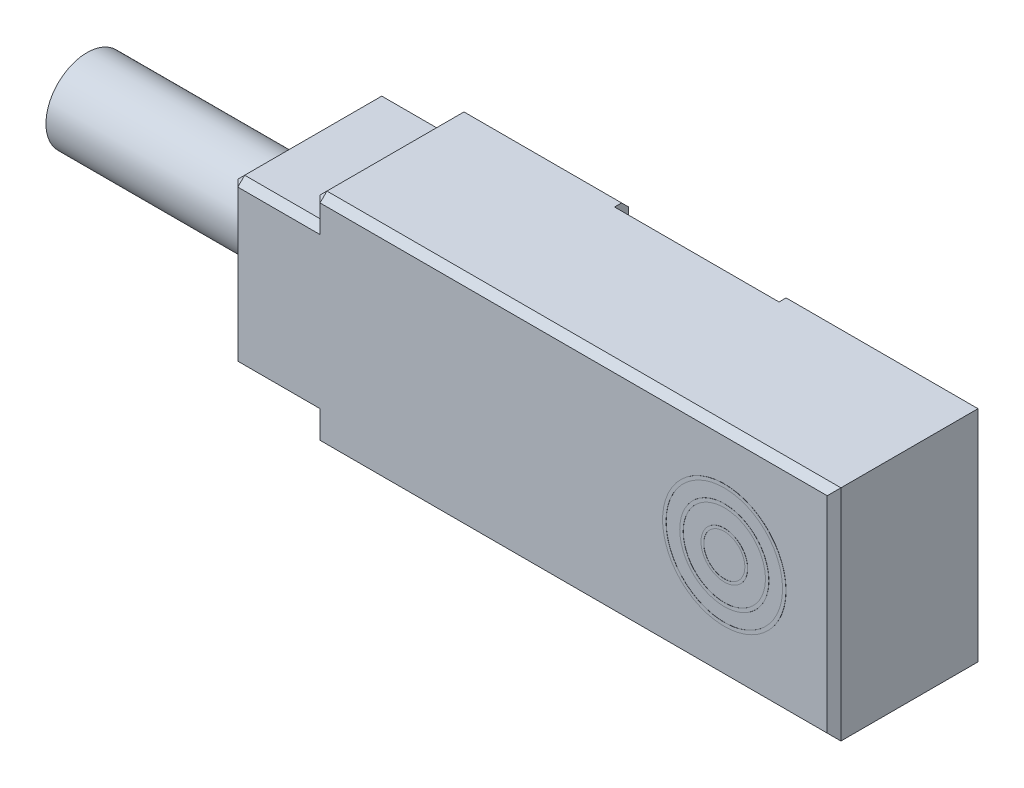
ISO-10303-21;
HEADER;
FILE_DESCRIPTION(('STEP AP214'),'2;1');
FILE_NAME('part.step','',(''),(''),'','','');
FILE_SCHEMA(('AUTOMOTIVE_DESIGN { 1 0 10303 214 1 1 1 1 }'));
ENDSEC;
DATA;
#1=APPLICATION_CONTEXT('core data for automotive mechanical design processes');
#2=APPLICATION_PROTOCOL_DEFINITION('international standard','automotive_design',2000,#1);
#3=PRODUCT_CONTEXT('',#1,'mechanical');
#4=PRODUCT('Part','Part','',(#3));
#5=PRODUCT_RELATED_PRODUCT_CATEGORY('part','',(#4));
#6=PRODUCT_DEFINITION_FORMATION('','',#4);
#7=PRODUCT_DEFINITION_CONTEXT('part definition',#1,'design');
#8=PRODUCT_DEFINITION('design','',#6,#7);
#9=PRODUCT_DEFINITION_SHAPE('','',#8);
#10=(LENGTH_UNIT() NAMED_UNIT(*) SI_UNIT(.MILLI.,.METRE.));
#11=(NAMED_UNIT(*) PLANE_ANGLE_UNIT() SI_UNIT($,.RADIAN.));
#12=(NAMED_UNIT(*) SI_UNIT($,.STERADIAN.) SOLID_ANGLE_UNIT());
#13=UNCERTAINTY_MEASURE_WITH_UNIT(LENGTH_MEASURE(1.E-05),#10,'distance_accuracy_value','');
#14=(GEOMETRIC_REPRESENTATION_CONTEXT(3) GLOBAL_UNCERTAINTY_ASSIGNED_CONTEXT((#13)) GLOBAL_UNIT_ASSIGNED_CONTEXT((#10,
#11,#12)) REPRESENTATION_CONTEXT('',''));
#15=CARTESIAN_POINT('',(0.,0.,0.));
#16=DIRECTION('',(0.,0.,1.));
#17=DIRECTION('',(1.,0.,0.));
#18=AXIS2_PLACEMENT_3D('',#15,#16,#17);
#19=CARTESIAN_POINT('',(0.,0.,-2.75));
#20=DIRECTION('',(0.,0.,1.));
#21=DIRECTION('',(1.,0.,0.));
#22=AXIS2_PLACEMENT_3D('',#19,#20,#21);
#23=PLANE('',#22);
#24=DIRECTION('',(0.,-1.,0.));
#25=VECTOR('',#24,1.);
#26=CARTESIAN_POINT('',(7.,-2.25,-2.75));
#27=LINE('',#26,#25);
#28=CARTESIAN_POINT('',(7.,3.74999999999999,-2.75));
#29=VERTEX_POINT('',#28);
#30=CARTESIAN_POINT('',(7.,-3.74999999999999,-2.75));
#31=VERTEX_POINT('',#30);
#32=EDGE_CURVE('E288',#29,#31,#27,.T.);
#33=ORIENTED_EDGE('',*,*,#32,.F.);
#34=DIRECTION('',(1.,0.,0.));
#35=VECTOR('',#34,1.);
#36=CARTESIAN_POINT('',(14.,3.74999999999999,-2.75));
#37=LINE('',#36,#35);
#38=CARTESIAN_POINT('',(13.75,3.74999999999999,-2.75));
#39=VERTEX_POINT('',#38);
#40=EDGE_CURVE('E369',#29,#39,#37,.T.);
#41=ORIENTED_EDGE('',*,*,#40,.T.);
#42=DIRECTION('',(0.,-1.,0.));
#43=VECTOR('',#42,1.);
#44=CARTESIAN_POINT('',(13.75,-4.,-2.75));
#45=LINE('',#44,#43);
#46=CARTESIAN_POINT('',(13.75,-3.74999999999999,-2.75));
#47=VERTEX_POINT('',#46);
#48=EDGE_CURVE('E373',#39,#47,#45,.T.);
#49=ORIENTED_EDGE('',*,*,#48,.T.);
#50=DIRECTION('',(-1.,0.,0.));
#51=VECTOR('',#50,1.);
#52=CARTESIAN_POINT('',(7.,-3.74999999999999,-2.75));
#53=LINE('',#52,#51);
#54=EDGE_CURVE('E375',#47,#31,#53,.T.);
#55=ORIENTED_EDGE('',*,*,#54,.T.);
#56=EDGE_LOOP('',(#33,#41,#49,#55));
#57=FACE_BOUND('',#56,.T.);
#58=ADVANCED_FACE('F33',(#57),#23,.F.);
#59=CARTESIAN_POINT('',(14.,4.,-2.5));
#60=DIRECTION('',(0.,0.707106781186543,-0.707106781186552));
#61=DIRECTION('',(1.,0.,0.));
#62=AXIS2_PLACEMENT_3D('',#59,#60,#61);
#63=PLANE('',#62);
#64=DIRECTION('',(0.,-0.707106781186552,-0.707106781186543));
#65=VECTOR('',#64,1.);
#66=CARTESIAN_POINT('',(7.,4.,-2.5));
#67=LINE('',#66,#65);
#68=CARTESIAN_POINT('',(7.,4.,-2.5));
#69=VERTEX_POINT('',#68);
#70=EDGE_CURVE('E11',#69,#29,#67,.T.);
#71=ORIENTED_EDGE('',*,*,#70,.F.);
#72=DIRECTION('',(-1.,0.,0.));
#73=VECTOR('',#72,1.);
#74=CARTESIAN_POINT('',(-5.,4.,-2.5));
#75=LINE('',#74,#73);
#76=CARTESIAN_POINT('',(14.,4.,-2.5));
#77=VERTEX_POINT('',#76);
#78=EDGE_CURVE('E390',#77,#69,#75,.T.);
#79=ORIENTED_EDGE('',*,*,#78,.F.);
#80=DIRECTION('',(-0.577350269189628,-0.577350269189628,-0.57735026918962));
#81=VECTOR('',#80,1.);
#82=CARTESIAN_POINT('',(14.,4.,-2.5));
#83=LINE('',#82,#81);
#84=EDGE_CURVE('E453',#39,#77,#83,.F.);
#85=ORIENTED_EDGE('',*,*,#84,.F.);
#86=ORIENTED_EDGE('',*,*,#40,.F.);
#87=EDGE_LOOP('',(#71,#79,#85,#86));
#88=FACE_BOUND('',#87,.T.);
#89=ADVANCED_FACE('F693',(#88),#63,.T.);
#90=CARTESIAN_POINT('',(14.,-4.,-2.75));
#91=DIRECTION('',(1.,0.,0.));
#92=DIRECTION('',(0.,0.,-1.));
#93=AXIS2_PLACEMENT_3D('',#90,#91,#92);
#94=PLANE('',#93);
#95=DIRECTION('',(0.,0.,1.));
#96=VECTOR('',#95,1.);
#97=CARTESIAN_POINT('',(14.,-4.,-2.75));
#98=LINE('',#97,#96);
#99=CARTESIAN_POINT('',(14.,-4.,-2.5));
#100=VERTEX_POINT('',#99);
#101=CARTESIAN_POINT('',(14.,-4.,2.49999999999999));
#102=VERTEX_POINT('',#101);
#103=EDGE_CURVE('E337',#100,#102,#98,.T.);
#104=ORIENTED_EDGE('',*,*,#103,.F.);
#105=DIRECTION('',(0.,1.,0.));
#106=VECTOR('',#105,1.);
#107=CARTESIAN_POINT('',(14.,4.,-2.5));
#108=LINE('',#107,#106);
#109=EDGE_CURVE('E383',#100,#77,#108,.T.);
#110=ORIENTED_EDGE('',*,*,#109,.T.);
#111=DIRECTION('',(0.,0.,1.));
#112=VECTOR('',#111,1.);
#113=CARTESIAN_POINT('',(14.,4.,-2.75));
#114=LINE('',#113,#112);
#115=CARTESIAN_POINT('',(14.,4.,2.49999999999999));
#116=VERTEX_POINT('',#115);
#117=EDGE_CURVE('E336',#77,#116,#114,.T.);
#118=ORIENTED_EDGE('',*,*,#117,.T.);
#119=DIRECTION('',(0.,-1.,0.));
#120=VECTOR('',#119,1.);
#121=CARTESIAN_POINT('',(14.,-4.,2.49999999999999));
#122=LINE('',#121,#120);
#123=EDGE_CURVE('E381',#116,#102,#122,.T.);
#124=ORIENTED_EDGE('',*,*,#123,.T.);
#125=EDGE_LOOP('',(#104,#110,#118,#124));
#126=FACE_BOUND('',#125,.T.);
#127=ADVANCED_FACE('F587',(#126),#94,.T.);
#128=CARTESIAN_POINT('',(-8.,-4.,-2.75));
#129=DIRECTION('',(0.,-1.,0.));
#130=DIRECTION('',(0.,0.,-1.));
#131=AXIS2_PLACEMENT_3D('',#128,#129,#130);
#132=PLANE('',#131);
#133=DIRECTION('',(0.,0.,1.));
#134=VECTOR('',#133,1.);
#135=CARTESIAN_POINT('',(7.,-4.,-2.75));
#136=LINE('',#135,#134);
#137=CARTESIAN_POINT('',(7.,-4.,-2.5));
#138=VERTEX_POINT('',#137);
#139=CARTESIAN_POINT('',(7.,-4.,-0.249999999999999));
#140=VERTEX_POINT('',#139);
#141=EDGE_CURVE('E289',#138,#140,#136,.T.);
#142=ORIENTED_EDGE('',*,*,#141,.F.);
#143=DIRECTION('',(1.,0.,0.));
#144=VECTOR('',#143,1.);
#145=CARTESIAN_POINT('',(14.,-4.,-2.5));
#146=LINE('',#145,#144);
#147=EDGE_CURVE('E354',#138,#100,#146,.T.);
#148=ORIENTED_EDGE('',*,*,#147,.T.);
#149=ORIENTED_EDGE('',*,*,#103,.T.);
#150=DIRECTION('',(-1.,0.,0.));
#151=VECTOR('',#150,1.);
#152=CARTESIAN_POINT('',(-8.,-4.,2.49999999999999));
#153=LINE('',#152,#151);
#154=CARTESIAN_POINT('',(-4.75,-4.,2.49999999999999));
#155=VERTEX_POINT('',#154);
#156=EDGE_CURVE('E352',#102,#155,#153,.T.);
#157=ORIENTED_EDGE('',*,*,#156,.T.);
#158=DIRECTION('',(0.,0.,-1.));
#159=VECTOR('',#158,1.);
#160=CARTESIAN_POINT('',(-4.75,-4.,-2.75));
#161=LINE('',#160,#159);
#162=CARTESIAN_POINT('',(-4.75,-4.,-2.5));
#163=VERTEX_POINT('',#162);
#164=EDGE_CURVE('E348',#155,#163,#161,.T.);
#165=ORIENTED_EDGE('',*,*,#164,.T.);
#166=DIRECTION('',(1.,0.,0.));
#167=VECTOR('',#166,1.);
#168=CARTESIAN_POINT('',(-2.625,-4.,-2.5));
#169=LINE('',#168,#167);
#170=CARTESIAN_POINT('',(-2.625,-4.,-2.5));
#171=VERTEX_POINT('',#170);
#172=EDGE_CURVE('E350',#163,#171,#169,.T.);
#173=ORIENTED_EDGE('',*,*,#172,.T.);
#174=DIRECTION('',(0.,0.,-1.));
#175=VECTOR('',#174,1.);
#176=CARTESIAN_POINT('',(-2.625,-4.,0.25));
#177=LINE('',#176,#175);
#178=CARTESIAN_POINT('',(-2.625,-4.,0.25));
#179=VERTEX_POINT('',#178);
#180=EDGE_CURVE('E313',#179,#171,#177,.T.);
#181=ORIENTED_EDGE('',*,*,#180,.F.);
#182=DIRECTION('',(-1.,0.,0.));
#183=VECTOR('',#182,1.);
#184=CARTESIAN_POINT('',(-1.125,-4.,0.25));
#185=LINE('',#184,#183);
#186=CARTESIAN_POINT('',(-1.125,-4.,0.25));
#187=VERTEX_POINT('',#186);
#188=EDGE_CURVE('E300',#187,#179,#185,.T.);
#189=ORIENTED_EDGE('',*,*,#188,.F.);
#190=DIRECTION('',(0.,0.,-1.));
#191=VECTOR('',#190,1.);
#192=CARTESIAN_POINT('',(-1.125,-4.,0.25));
#193=LINE('',#192,#191);
#194=CARTESIAN_POINT('',(-1.125,-4.,-2.5));
#195=VERTEX_POINT('',#194);
#196=EDGE_CURVE('E320',#187,#195,#193,.T.);
#197=ORIENTED_EDGE('',*,*,#196,.T.);
#198=DIRECTION('',(1.,0.,0.));
#199=VECTOR('',#198,1.);
#200=CARTESIAN_POINT('',(1.,-4.,-2.5));
#201=LINE('',#200,#199);
#202=CARTESIAN_POINT('',(1.,-4.,-2.5));
#203=VERTEX_POINT('',#202);
#204=EDGE_CURVE('E345',#195,#203,#201,.T.);
#205=ORIENTED_EDGE('',*,*,#204,.T.);
#206=DIRECTION('',(0.,0.,-1.));
#207=VECTOR('',#206,1.);
#208=CARTESIAN_POINT('',(0.999999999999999,-4.,-0.25));
#209=LINE('',#208,#207);
#210=CARTESIAN_POINT('',(0.999999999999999,-4.,-0.25));
#211=VERTEX_POINT('',#210);
#212=EDGE_CURVE('E277',#211,#203,#209,.T.);
#213=ORIENTED_EDGE('',*,*,#212,.F.);
#214=DIRECTION('',(-1.,0.,0.));
#215=VECTOR('',#214,1.);
#216=CARTESIAN_POINT('',(7.,-4.,-0.249999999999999));
#217=LINE('',#216,#215);
#218=EDGE_CURVE('E281',#140,#211,#217,.T.);
#219=ORIENTED_EDGE('',*,*,#218,.F.);
#220=EDGE_LOOP('',(#142,#148,#149,#157,#165,#173,#181,#189,#197,#205,#213,#219));
#221=FACE_BOUND('',#220,.T.);
#222=ADVANCED_FACE('F591',(#221),#132,.T.);
#223=CARTESIAN_POINT('',(-8.,4.,-2.75));
#224=DIRECTION('',(-1.,0.,0.));
#225=DIRECTION('',(0.,0.,1.));
#226=AXIS2_PLACEMENT_3D('',#223,#224,#225);
#227=PLANE('',#226);
#228=DIRECTION('',(0.,1.,0.));
#229=VECTOR('',#228,1.);
#230=CARTESIAN_POINT('',(-8.,4.,2.5));
#231=LINE('',#230,#229);
#232=CARTESIAN_POINT('',(-8.,-2.75,2.5));
#233=VERTEX_POINT('',#232);
#234=CARTESIAN_POINT('',(-8.,2.75,2.5));
#235=VERTEX_POINT('',#234);
#236=EDGE_CURVE('E410',#233,#235,#231,.T.);
#237=ORIENTED_EDGE('',*,*,#236,.T.);
#238=DIRECTION('',(0.,0.,-1.));
#239=VECTOR('',#238,1.);
#240=CARTESIAN_POINT('',(-8.,2.75,-2.75));
#241=LINE('',#240,#239);
#242=CARTESIAN_POINT('',(-8.,2.75,-2.5));
#243=VERTEX_POINT('',#242);
#244=EDGE_CURVE('E412',#235,#243,#241,.T.);
#245=ORIENTED_EDGE('',*,*,#244,.T.);
#246=DIRECTION('',(0.,-1.,0.));
#247=VECTOR('',#246,1.);
#248=CARTESIAN_POINT('',(-8.,-3.,-2.5));
#249=LINE('',#248,#247);
#250=CARTESIAN_POINT('',(-8.,-2.75,-2.5));
#251=VERTEX_POINT('',#250);
#252=EDGE_CURVE('E406',#243,#251,#249,.T.);
#253=ORIENTED_EDGE('',*,*,#252,.T.);
#254=DIRECTION('',(0.,0.,1.));
#255=VECTOR('',#254,1.);
#256=CARTESIAN_POINT('',(-8.,-2.75,2.75));
#257=LINE('',#256,#255);
#258=EDGE_CURVE('E408',#251,#233,#257,.T.);
#259=ORIENTED_EDGE('',*,*,#258,.T.);
#260=EDGE_LOOP('',(#237,#245,#253,#259));
#261=FACE_BOUND('',#260,.T.);
#262=CARTESIAN_POINT('',(-8.,0.,0.));
#263=DIRECTION('',(1.,0.,0.));
#264=DIRECTION('',(0.,0.,-1.));
#265=AXIS2_PLACEMENT_3D('',#262,#263,#264);
#266=CIRCLE('',#265,1.5);
#267=CARTESIAN_POINT('',(-8.,0.,-1.5));
#268=VERTEX_POINT('',#267);
#269=EDGE_CURVE('E1296',#268,#268,#266,.T.);
#270=ORIENTED_EDGE('',*,*,#269,.T.);
#271=EDGE_LOOP('',(#270));
#272=FACE_BOUND('',#271,.T.);
#273=ADVANCED_FACE('F671',(#261,#272),#227,.T.);
#274=CARTESIAN_POINT('',(14.,4.,-2.75));
#275=DIRECTION('',(0.,1.,0.));
#276=DIRECTION('',(0.,0.,1.));
#277=AXIS2_PLACEMENT_3D('',#274,#275,#276);
#278=PLANE('',#277);
#279=DIRECTION('',(0.,0.,-1.));
#280=VECTOR('',#279,1.);
#281=CARTESIAN_POINT('',(7.,4.,-2.242));
#282=LINE('',#281,#280);
#283=CARTESIAN_POINT('',(7.,4.,-2.242));
#284=VERTEX_POINT('',#283);
#285=EDGE_CURVE('E454',#284,#69,#282,.T.);
#286=ORIENTED_EDGE('',*,*,#285,.F.);
#287=DIRECTION('',(1.,0.,0.));
#288=VECTOR('',#287,1.);
#289=CARTESIAN_POINT('',(7.,4.,-2.242));
#290=LINE('',#289,#288);
#291=CARTESIAN_POINT('',(0.999999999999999,4.,-2.242));
#292=VERTEX_POINT('',#291);
#293=EDGE_CURVE('E257',#292,#284,#290,.T.);
#294=ORIENTED_EDGE('',*,*,#293,.F.);
#295=DIRECTION('',(0.,0.,-1.));
#296=VECTOR('',#295,1.);
#297=CARTESIAN_POINT('',(0.999999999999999,4.,-2.242));
#298=LINE('',#297,#296);
#299=CARTESIAN_POINT('',(0.999999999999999,4.,-2.5));
#300=VERTEX_POINT('',#299);
#301=EDGE_CURVE('E546',#292,#300,#298,.T.);
#302=ORIENTED_EDGE('',*,*,#301,.T.);
#303=CARTESIAN_POINT('',(-4.74999999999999,4.,-2.5));
#304=VERTEX_POINT('',#303);
#305=EDGE_CURVE('E389',#300,#304,#75,.T.);
#306=ORIENTED_EDGE('',*,*,#305,.T.);
#307=DIRECTION('',(0.,0.,1.));
#308=VECTOR('',#307,1.);
#309=CARTESIAN_POINT('',(-4.74999999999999,4.,2.75));
#310=LINE('',#309,#308);
#311=CARTESIAN_POINT('',(-4.74999999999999,4.,2.49999999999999));
#312=VERTEX_POINT('',#311);
#313=EDGE_CURVE('E387',#304,#312,#310,.T.);
#314=ORIENTED_EDGE('',*,*,#313,.T.);
#315=DIRECTION('',(1.,0.,0.));
#316=VECTOR('',#315,1.);
#317=CARTESIAN_POINT('',(14.,4.,2.49999999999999));
#318=LINE('',#317,#316);
#319=EDGE_CURVE('E385',#312,#116,#318,.T.);
#320=ORIENTED_EDGE('',*,*,#319,.T.);
#321=ORIENTED_EDGE('',*,*,#117,.F.);
#322=ORIENTED_EDGE('',*,*,#78,.T.);
#323=EDGE_LOOP('',(#286,#294,#302,#306,#314,#320,#321,#322));
#324=FACE_BOUND('',#323,.T.);
#325=ADVANCED_FACE('F551',(#324),#278,.T.);
#326=CARTESIAN_POINT('',(-4.74999999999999,3.74999999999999,-2.75));
#327=VERTEX_POINT('',#326);
#328=CARTESIAN_POINT('',(0.999999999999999,3.74999999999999,-2.75));
#329=VERTEX_POINT('',#328);
#330=EDGE_CURVE('E370',#327,#329,#37,.T.);
#331=ORIENTED_EDGE('',*,*,#330,.T.);
#332=DIRECTION('',(0.,-1.,0.));
#333=VECTOR('',#332,1.);
#334=CARTESIAN_POINT('',(1.,-2.25,-2.75));
#335=LINE('',#334,#333);
#336=CARTESIAN_POINT('',(1.,-3.74999999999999,-2.75));
#337=VERTEX_POINT('',#336);
#338=EDGE_CURVE('E48',#329,#337,#335,.T.);
#339=ORIENTED_EDGE('',*,*,#338,.T.);
#340=DIRECTION('',(-1.,0.,0.));
#341=VECTOR('',#340,1.);
#342=CARTESIAN_POINT('',(-1.125,-3.74999999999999,-2.75));
#343=LINE('',#342,#341);
#344=CARTESIAN_POINT('',(-1.125,-3.74999999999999,-2.75));
#345=VERTEX_POINT('',#344);
#346=EDGE_CURVE('E357',#337,#345,#343,.T.);
#347=ORIENTED_EDGE('',*,*,#346,.T.);
#348=DIRECTION('',(0.,-1.,0.));
#349=VECTOR('',#348,1.);
#350=CARTESIAN_POINT('',(-1.125,-2.5,-2.75));
#351=LINE('',#350,#349);
#352=CARTESIAN_POINT('',(-1.125,-2.5,-2.75));
#353=VERTEX_POINT('',#352);
#354=EDGE_CURVE('E304',#353,#345,#351,.T.);
#355=ORIENTED_EDGE('',*,*,#354,.F.);
#356=DIRECTION('',(1.,0.,0.));
#357=VECTOR('',#356,1.);
#358=CARTESIAN_POINT('',(-2.625,-2.5,-2.75));
#359=LINE('',#358,#357);
#360=CARTESIAN_POINT('',(-2.625,-2.5,-2.75));
#361=VERTEX_POINT('',#360);
#362=EDGE_CURVE('E315',#361,#353,#359,.T.);
#363=ORIENTED_EDGE('',*,*,#362,.F.);
#364=DIRECTION('',(0.,1.,0.));
#365=VECTOR('',#364,1.);
#366=CARTESIAN_POINT('',(-2.625,-4.,-2.75));
#367=LINE('',#366,#365);
#368=CARTESIAN_POINT('',(-2.625,-3.74999999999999,-2.75));
#369=VERTEX_POINT('',#368);
#370=EDGE_CURVE('E295',#369,#361,#367,.T.);
#371=ORIENTED_EDGE('',*,*,#370,.F.);
#372=DIRECTION('',(-1.,0.,0.));
#373=VECTOR('',#372,1.);
#374=CARTESIAN_POINT('',(-5.,-3.74999999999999,-2.75));
#375=LINE('',#374,#373);
#376=CARTESIAN_POINT('',(-4.74999999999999,-3.74999999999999,-2.75));
#377=VERTEX_POINT('',#376);
#378=EDGE_CURVE('E377',#369,#377,#375,.T.);
#379=ORIENTED_EDGE('',*,*,#378,.T.);
#380=DIRECTION('',(0.,1.,0.));
#381=VECTOR('',#380,1.);
#382=CARTESIAN_POINT('',(-4.74999999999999,0.,-2.75));
#383=LINE('',#382,#381);
#384=CARTESIAN_POINT('',(-4.74999999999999,-2.74999999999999,-2.75));
#385=VERTEX_POINT('',#384);
#386=EDGE_CURVE('E367',#377,#385,#383,.T.);
#387=ORIENTED_EDGE('',*,*,#386,.T.);
#388=DIRECTION('',(-1.,0.,0.));
#389=VECTOR('',#388,1.);
#390=CARTESIAN_POINT('',(0.,-2.74999999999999,-2.75));
#391=LINE('',#390,#389);
#392=CARTESIAN_POINT('',(-7.74999999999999,-2.74999999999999,-2.75));
#393=VERTEX_POINT('',#392);
#394=EDGE_CURVE('E365',#385,#393,#391,.T.);
#395=ORIENTED_EDGE('',*,*,#394,.T.);
#396=DIRECTION('',(0.,1.,0.));
#397=VECTOR('',#396,1.);
#398=CARTESIAN_POINT('',(-7.74999999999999,3.,-2.75));
#399=LINE('',#398,#397);
#400=CARTESIAN_POINT('',(-7.74999999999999,2.74999999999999,-2.75));
#401=VERTEX_POINT('',#400);
#402=EDGE_CURVE('E359',#393,#401,#399,.T.);
#403=ORIENTED_EDGE('',*,*,#402,.T.);
#404=DIRECTION('',(1.,0.,0.));
#405=VECTOR('',#404,1.);
#406=CARTESIAN_POINT('',(0.,2.74999999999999,-2.75));
#407=LINE('',#406,#405);
#408=CARTESIAN_POINT('',(-4.74999999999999,2.74999999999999,-2.75));
#409=VERTEX_POINT('',#408);
#410=EDGE_CURVE('E361',#401,#409,#407,.T.);
#411=ORIENTED_EDGE('',*,*,#410,.T.);
#412=DIRECTION('',(0.,1.,0.));
#413=VECTOR('',#412,1.);
#414=CARTESIAN_POINT('',(-4.74999999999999,0.,-2.75));
#415=LINE('',#414,#413);
#416=EDGE_CURVE('E363',#409,#327,#415,.T.);
#417=ORIENTED_EDGE('',*,*,#416,.T.);
#418=EDGE_LOOP('',(#331,#339,#347,#355,#363,#371,#379,#387,#395,#403,#411,#417));
#419=FACE_BOUND('',#418,.T.);
#420=ADVANCED_FACE('F621',(#419),#23,.F.);
#421=CARTESIAN_POINT('',(0.,0.,2.75));
#422=DIRECTION('',(0.,0.,1.));
#423=DIRECTION('',(1.,0.,0.));
#424=AXIS2_PLACEMENT_3D('',#421,#422,#423);
#425=PLANE('',#424);
#426=DIRECTION('',(-1.,0.,0.));
#427=VECTOR('',#426,1.);
#428=CARTESIAN_POINT('',(0.,3.75,2.75));
#429=LINE('',#428,#427);
#430=CARTESIAN_POINT('',(13.75,3.75,2.75));
#431=VERTEX_POINT('',#430);
#432=CARTESIAN_POINT('',(-4.75,3.75,2.75));
#433=VERTEX_POINT('',#432);
#434=EDGE_CURVE('E436',#431,#433,#429,.T.);
#435=ORIENTED_EDGE('',*,*,#434,.T.);
#436=DIRECTION('',(0.,-1.,0.));
#437=VECTOR('',#436,1.);
#438=CARTESIAN_POINT('',(-4.75,3.,2.75));
#439=LINE('',#438,#437);
#440=CARTESIAN_POINT('',(-4.75,2.75,2.75));
#441=VERTEX_POINT('',#440);
#442=EDGE_CURVE('E442',#433,#441,#439,.T.);
#443=ORIENTED_EDGE('',*,*,#442,.T.);
#444=DIRECTION('',(-1.,0.,0.));
#445=VECTOR('',#444,1.);
#446=CARTESIAN_POINT('',(-8.,2.75,2.75));
#447=LINE('',#446,#445);
#448=CARTESIAN_POINT('',(-7.74999999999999,2.75,2.75));
#449=VERTEX_POINT('',#448);
#450=EDGE_CURVE('E440',#441,#449,#447,.T.);
#451=ORIENTED_EDGE('',*,*,#450,.T.);
#452=DIRECTION('',(0.,-1.,0.));
#453=VECTOR('',#452,1.);
#454=CARTESIAN_POINT('',(-7.74999999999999,0.,2.75));
#455=LINE('',#454,#453);
#456=CARTESIAN_POINT('',(-7.74999999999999,-2.75,2.75));
#457=VERTEX_POINT('',#456);
#458=EDGE_CURVE('E438',#449,#457,#455,.T.);
#459=ORIENTED_EDGE('',*,*,#458,.T.);
#460=DIRECTION('',(1.,0.,0.));
#461=VECTOR('',#460,1.);
#462=CARTESIAN_POINT('',(-5.,-2.75,2.75));
#463=LINE('',#462,#461);
#464=CARTESIAN_POINT('',(-4.75,-2.75,2.75));
#465=VERTEX_POINT('',#464);
#466=EDGE_CURVE('E428',#457,#465,#463,.T.);
#467=ORIENTED_EDGE('',*,*,#466,.T.);
#468=DIRECTION('',(0.,-1.,0.));
#469=VECTOR('',#468,1.);
#470=CARTESIAN_POINT('',(-4.75,-4.,2.75));
#471=LINE('',#470,#469);
#472=CARTESIAN_POINT('',(-4.75,-3.75,2.75));
#473=VERTEX_POINT('',#472);
#474=EDGE_CURVE('E430',#465,#473,#471,.T.);
#475=ORIENTED_EDGE('',*,*,#474,.T.);
#476=DIRECTION('',(1.,0.,0.));
#477=VECTOR('',#476,1.);
#478=CARTESIAN_POINT('',(0.,-3.75,2.75));
#479=LINE('',#478,#477);
#480=CARTESIAN_POINT('',(13.75,-3.75,2.75));
#481=VERTEX_POINT('',#480);
#482=EDGE_CURVE('E432',#473,#481,#479,.T.);
#483=ORIENTED_EDGE('',*,*,#482,.T.);
#484=DIRECTION('',(0.,1.,0.));
#485=VECTOR('',#484,1.);
#486=CARTESIAN_POINT('',(13.75,0.,2.75));
#487=LINE('',#486,#485);
#488=EDGE_CURVE('E434',#481,#431,#487,.T.);
#489=ORIENTED_EDGE('',*,*,#488,.T.);
#490=EDGE_LOOP('',(#435,#443,#451,#459,#467,#475,#483,#489));
#491=FACE_BOUND('',#490,.T.);
#492=CARTESIAN_POINT('',(10.,0.,2.75));
#493=DIRECTION('',(0.,0.,1.));
#494=DIRECTION('',(1.,0.,0.));
#495=AXIS2_PLACEMENT_3D('',#492,#493,#494);
#496=CIRCLE('',#495,2.25);
#497=CARTESIAN_POINT('',(12.25,0.,2.75));
#498=VERTEX_POINT('',#497);
#499=EDGE_CURVE('E284',#498,#498,#496,.T.);
#500=ORIENTED_EDGE('',*,*,#499,.F.);
#501=EDGE_LOOP('',(#500));
#502=FACE_BOUND('',#501,.T.);
#503=ADVANCED_FACE('F576',(#491,#502),#425,.T.);
#504=CARTESIAN_POINT('',(-5.,3.,2.75));
#505=DIRECTION('',(0.,-1.,0.));
#506=DIRECTION('',(0.,0.,-1.));
#507=AXIS2_PLACEMENT_3D('',#504,#505,#506);
#508=PLANE('',#507);
#509=DIRECTION('',(0.,0.,1.));
#510=VECTOR('',#509,1.);
#511=CARTESIAN_POINT('',(-7.74999999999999,3.,2.75));
#512=LINE('',#511,#510);
#513=CARTESIAN_POINT('',(-7.74999999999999,3.,-2.5));
#514=VERTEX_POINT('',#513);
#515=CARTESIAN_POINT('',(-7.74999999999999,3.,2.49999999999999));
#516=VERTEX_POINT('',#515);
#517=EDGE_CURVE('E417',#514,#516,#512,.T.);
#518=ORIENTED_EDGE('',*,*,#517,.T.);
#519=DIRECTION('',(1.,0.,0.));
#520=VECTOR('',#519,1.);
#521=CARTESIAN_POINT('',(-5.,3.,2.49999999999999));
#522=LINE('',#521,#520);
#523=CARTESIAN_POINT('',(-5.,3.,2.49999999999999));
#524=VERTEX_POINT('',#523);
#525=EDGE_CURVE('E420',#516,#524,#522,.T.);
#526=ORIENTED_EDGE('',*,*,#525,.T.);
#527=DIRECTION('',(0.,0.,-1.));
#528=VECTOR('',#527,1.);
#529=CARTESIAN_POINT('',(-5.,3.,2.75));
#530=LINE('',#529,#528);
#531=CARTESIAN_POINT('',(-5.,3.,-2.5));
#532=VERTEX_POINT('',#531);
#533=EDGE_CURVE('E333',#524,#532,#530,.T.);
#534=ORIENTED_EDGE('',*,*,#533,.T.);
#535=DIRECTION('',(-1.,0.,0.));
#536=VECTOR('',#535,1.);
#537=CARTESIAN_POINT('',(-5.,3.,-2.5));
#538=LINE('',#537,#536);
#539=EDGE_CURVE('E415',#532,#514,#538,.T.);
#540=ORIENTED_EDGE('',*,*,#539,.T.);
#541=EDGE_LOOP('',(#518,#526,#534,#540));
#542=FACE_BOUND('',#541,.T.);
#543=ADVANCED_FACE('F652',(#542),#508,.F.);
#544=CARTESIAN_POINT('',(-5.,4.,2.75));
#545=DIRECTION('',(1.,0.,0.));
#546=DIRECTION('',(0.,0.,-1.));
#547=AXIS2_PLACEMENT_3D('',#544,#545,#546);
#548=PLANE('',#547);
#549=ORIENTED_EDGE('',*,*,#533,.F.);
#550=DIRECTION('',(0.,1.,0.));
#551=VECTOR('',#550,1.);
#552=CARTESIAN_POINT('',(-5.,4.,2.49999999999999));
#553=LINE('',#552,#551);
#554=CARTESIAN_POINT('',(-5.,3.75,2.49999999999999));
#555=VERTEX_POINT('',#554);
#556=EDGE_CURVE('E426',#524,#555,#553,.T.);
#557=ORIENTED_EDGE('',*,*,#556,.T.);
#558=DIRECTION('',(0.,0.,-1.));
#559=VECTOR('',#558,1.);
#560=CARTESIAN_POINT('',(-5.,3.75,-2.75));
#561=LINE('',#560,#559);
#562=CARTESIAN_POINT('',(-5.,3.75,-2.5));
#563=VERTEX_POINT('',#562);
#564=EDGE_CURVE('E424',#555,#563,#561,.T.);
#565=ORIENTED_EDGE('',*,*,#564,.T.);
#566=DIRECTION('',(0.,-1.,0.));
#567=VECTOR('',#566,1.);
#568=CARTESIAN_POINT('',(-5.,4.,-2.5));
#569=LINE('',#568,#567);
#570=EDGE_CURVE('E422',#563,#532,#569,.T.);
#571=ORIENTED_EDGE('',*,*,#570,.T.);
#572=EDGE_LOOP('',(#549,#557,#565,#571));
#573=FACE_BOUND('',#572,.T.);
#574=ADVANCED_FACE('F649',(#573),#548,.F.);
#575=CARTESIAN_POINT('',(-5.,-3.,2.75));
#576=DIRECTION('',(1.,0.,0.));
#577=DIRECTION('',(0.,1.,0.));
#578=AXIS2_PLACEMENT_3D('',#575,#576,#577);
#579=PLANE('',#578);
#580=DIRECTION('',(0.,0.,-1.));
#581=VECTOR('',#580,1.);
#582=CARTESIAN_POINT('',(-5.,-3.,2.75));
#583=LINE('',#582,#581);
#584=CARTESIAN_POINT('',(-5.,-3.,2.49999999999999));
#585=VERTEX_POINT('',#584);
#586=CARTESIAN_POINT('',(-5.,-3.,-2.5));
#587=VERTEX_POINT('',#586);
#588=EDGE_CURVE('E323',#585,#587,#583,.T.);
#589=ORIENTED_EDGE('',*,*,#588,.T.);
#590=DIRECTION('',(0.,-1.,0.));
#591=VECTOR('',#590,1.);
#592=CARTESIAN_POINT('',(-5.,-3.,-2.5));
#593=LINE('',#592,#591);
#594=CARTESIAN_POINT('',(-5.,-3.74999999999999,-2.5));
#595=VERTEX_POINT('',#594);
#596=EDGE_CURVE('E397',#587,#595,#593,.T.);
#597=ORIENTED_EDGE('',*,*,#596,.T.);
#598=DIRECTION('',(0.,0.,1.));
#599=VECTOR('',#598,1.);
#600=CARTESIAN_POINT('',(-5.,-3.74999999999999,2.75));
#601=LINE('',#600,#599);
#602=CARTESIAN_POINT('',(-5.,-3.74999999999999,2.49999999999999));
#603=VERTEX_POINT('',#602);
#604=EDGE_CURVE('E395',#595,#603,#601,.T.);
#605=ORIENTED_EDGE('',*,*,#604,.T.);
#606=DIRECTION('',(0.,1.,0.));
#607=VECTOR('',#606,1.);
#608=CARTESIAN_POINT('',(-5.,-3.,2.49999999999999));
#609=LINE('',#608,#607);
#610=EDGE_CURVE('E393',#603,#585,#609,.T.);
#611=ORIENTED_EDGE('',*,*,#610,.T.);
#612=EDGE_LOOP('',(#589,#597,#605,#611));
#613=FACE_BOUND('',#612,.T.);
#614=ADVANCED_FACE('F1186',(#613),#579,.F.);
#615=CARTESIAN_POINT('',(-8.,-3.,2.75));
#616=DIRECTION('',(0.,1.,0.));
#617=DIRECTION('',(0.,0.,1.));
#618=AXIS2_PLACEMENT_3D('',#615,#616,#617);
#619=PLANE('',#618);
#620=DIRECTION('',(0.,0.,-1.));
#621=VECTOR('',#620,1.);
#622=CARTESIAN_POINT('',(-7.74999999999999,-3.,-2.75));
#623=LINE('',#622,#621);
#624=CARTESIAN_POINT('',(-7.74999999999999,-3.,2.49999999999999));
#625=VERTEX_POINT('',#624);
#626=CARTESIAN_POINT('',(-7.74999999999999,-3.,-2.5));
#627=VERTEX_POINT('',#626);
#628=EDGE_CURVE('E400',#625,#627,#623,.T.);
#629=ORIENTED_EDGE('',*,*,#628,.T.);
#630=DIRECTION('',(1.,0.,0.));
#631=VECTOR('',#630,1.);
#632=CARTESIAN_POINT('',(-8.,-3.,-2.5));
#633=LINE('',#632,#631);
#634=EDGE_CURVE('E404',#627,#587,#633,.T.);
#635=ORIENTED_EDGE('',*,*,#634,.T.);
#636=ORIENTED_EDGE('',*,*,#588,.F.);
#637=DIRECTION('',(-1.,0.,0.));
#638=VECTOR('',#637,1.);
#639=CARTESIAN_POINT('',(-8.,-3.,2.49999999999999));
#640=LINE('',#639,#638);
#641=EDGE_CURVE('E402',#585,#625,#640,.T.);
#642=ORIENTED_EDGE('',*,*,#641,.T.);
#643=EDGE_LOOP('',(#629,#635,#636,#642));
#644=FACE_BOUND('',#643,.T.);
#645=ADVANCED_FACE('F1179',(#644),#619,.F.);
#646=CARTESIAN_POINT('',(-1.125,-2.5,0.25));
#647=DIRECTION('',(1.,0.,0.));
#648=DIRECTION('',(0.,0.,-1.));
#649=AXIS2_PLACEMENT_3D('',#646,#647,#648);
#650=PLANE('',#649);
#651=ORIENTED_EDGE('',*,*,#354,.T.);
#652=DIRECTION('',(0.,-0.707106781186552,0.707106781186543));
#653=VECTOR('',#652,1.);
#654=CARTESIAN_POINT('',(-1.125,-4.,-2.5));
#655=LINE('',#654,#653);
#656=EDGE_CURVE('E449',#345,#195,#655,.T.);
#657=ORIENTED_EDGE('',*,*,#656,.T.);
#658=ORIENTED_EDGE('',*,*,#196,.F.);
#659=DIRECTION('',(0.,-1.,0.));
#660=VECTOR('',#659,1.);
#661=CARTESIAN_POINT('',(-1.125,-2.5,0.25));
#662=LINE('',#661,#660);
#663=CARTESIAN_POINT('',(-1.125,-2.5,0.25));
#664=VERTEX_POINT('',#663);
#665=EDGE_CURVE('E310',#664,#187,#662,.T.);
#666=ORIENTED_EDGE('',*,*,#665,.F.);
#667=DIRECTION('',(0.,0.,-1.));
#668=VECTOR('',#667,1.);
#669=CARTESIAN_POINT('',(-1.125,-2.5,0.25));
#670=LINE('',#669,#668);
#671=EDGE_CURVE('E324',#664,#353,#670,.T.);
#672=ORIENTED_EDGE('',*,*,#671,.T.);
#673=EDGE_LOOP('',(#651,#657,#658,#666,#672));
#674=FACE_BOUND('',#673,.T.);
#675=ADVANCED_FACE('F1173',(#674),#650,.F.);
#676=CARTESIAN_POINT('',(-2.625,-2.5,0.25));
#677=DIRECTION('',(0.,1.,0.));
#678=DIRECTION('',(0.,0.,1.));
#679=AXIS2_PLACEMENT_3D('',#676,#677,#678);
#680=PLANE('',#679);
#681=ORIENTED_EDGE('',*,*,#362,.T.);
#682=ORIENTED_EDGE('',*,*,#671,.F.);
#683=DIRECTION('',(1.,0.,0.));
#684=VECTOR('',#683,1.);
#685=CARTESIAN_POINT('',(-2.625,-2.5,0.25));
#686=LINE('',#685,#684);
#687=CARTESIAN_POINT('',(-2.625,-2.5,0.25));
#688=VERTEX_POINT('',#687);
#689=EDGE_CURVE('E307',#688,#664,#686,.T.);
#690=ORIENTED_EDGE('',*,*,#689,.F.);
#691=DIRECTION('',(0.,0.,-1.));
#692=VECTOR('',#691,1.);
#693=CARTESIAN_POINT('',(-2.625,-2.5,0.25));
#694=LINE('',#693,#692);
#695=EDGE_CURVE('E326',#688,#361,#694,.T.);
#696=ORIENTED_EDGE('',*,*,#695,.T.);
#697=EDGE_LOOP('',(#681,#682,#690,#696));
#698=FACE_BOUND('',#697,.T.);
#699=ADVANCED_FACE('F630',(#698),#680,.F.);
#700=CARTESIAN_POINT('',(-2.625,-4.,0.25));
#701=DIRECTION('',(-1.,0.,0.));
#702=DIRECTION('',(0.,-1.,0.));
#703=AXIS2_PLACEMENT_3D('',#700,#701,#702);
#704=PLANE('',#703);
#705=ORIENTED_EDGE('',*,*,#180,.T.);
#706=DIRECTION('',(0.,0.707106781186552,-0.707106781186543));
#707=VECTOR('',#706,1.);
#708=CARTESIAN_POINT('',(-2.625,-4.,-2.5));
#709=LINE('',#708,#707);
#710=EDGE_CURVE('E445',#171,#369,#709,.T.);
#711=ORIENTED_EDGE('',*,*,#710,.T.);
#712=ORIENTED_EDGE('',*,*,#370,.T.);
#713=ORIENTED_EDGE('',*,*,#695,.F.);
#714=DIRECTION('',(0.,1.,0.));
#715=VECTOR('',#714,1.);
#716=CARTESIAN_POINT('',(-2.625,-4.,0.25));
#717=LINE('',#716,#715);
#718=EDGE_CURVE('E303',#179,#688,#717,.T.);
#719=ORIENTED_EDGE('',*,*,#718,.F.);
#720=EDGE_LOOP('',(#705,#711,#712,#713,#719));
#721=FACE_BOUND('',#720,.T.);
#722=ADVANCED_FACE('F627',(#721),#704,.F.);
#723=CARTESIAN_POINT('',(0.,0.,0.25));
#724=DIRECTION('',(0.,0.,-1.));
#725=DIRECTION('',(-1.,0.,0.));
#726=AXIS2_PLACEMENT_3D('',#723,#724,#725);
#727=PLANE('',#726);
#728=ORIENTED_EDGE('',*,*,#188,.T.);
#729=ORIENTED_EDGE('',*,*,#718,.T.);
#730=ORIENTED_EDGE('',*,*,#689,.T.);
#731=ORIENTED_EDGE('',*,*,#665,.T.);
#732=EDGE_LOOP('',(#728,#729,#730,#731));
#733=FACE_BOUND('',#732,.T.);
#734=ADVANCED_FACE('F633',(#733),#727,.T.);
#735=CARTESIAN_POINT('',(0.999999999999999,-2.25,-0.25));
#736=DIRECTION('',(-1.,0.,0.));
#737=DIRECTION('',(0.,0.,1.));
#738=AXIS2_PLACEMENT_3D('',#735,#736,#737);
#739=PLANE('',#738);
#740=ORIENTED_EDGE('',*,*,#212,.T.);
#741=DIRECTION('',(0.,0.707106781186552,-0.707106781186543));
#742=VECTOR('',#741,1.);
#743=CARTESIAN_POINT('',(1.,-4.,-2.49999999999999));
#744=LINE('',#743,#742);
#745=EDGE_CURVE('E447',#203,#337,#744,.T.);
#746=ORIENTED_EDGE('',*,*,#745,.T.);
#747=ORIENTED_EDGE('',*,*,#338,.F.);
#748=DIRECTION('',(0.,0.707106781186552,0.707106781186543));
#749=VECTOR('',#748,1.);
#750=CARTESIAN_POINT('',(0.999999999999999,4.,-2.5));
#751=LINE('',#750,#749);
#752=EDGE_CURVE('E41',#329,#300,#751,.T.);
#753=ORIENTED_EDGE('',*,*,#752,.T.);
#754=ORIENTED_EDGE('',*,*,#301,.F.);
#755=DIRECTION('',(0.,1.,0.));
#756=VECTOR('',#755,1.);
#757=CARTESIAN_POINT('',(0.999999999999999,-2.25,-2.242));
#758=LINE('',#757,#756);
#759=CARTESIAN_POINT('',(0.999999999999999,-2.25,-2.242));
#760=VERTEX_POINT('',#759);
#761=EDGE_CURVE('E269',#760,#292,#758,.T.);
#762=ORIENTED_EDGE('',*,*,#761,.F.);
#763=DIRECTION('',(0.,0.,-1.));
#764=VECTOR('',#763,1.);
#765=CARTESIAN_POINT('',(0.999999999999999,-2.25,-0.25));
#766=LINE('',#765,#764);
#767=CARTESIAN_POINT('',(0.999999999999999,-2.25,-0.25));
#768=VERTEX_POINT('',#767);
#769=EDGE_CURVE('E268',#768,#760,#766,.T.);
#770=ORIENTED_EDGE('',*,*,#769,.F.);
#771=DIRECTION('',(0.,-1.,0.));
#772=VECTOR('',#771,1.);
#773=CARTESIAN_POINT('',(0.999999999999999,-2.25,-0.25));
#774=LINE('',#773,#772);
#775=EDGE_CURVE('E296',#768,#211,#774,.T.);
#776=ORIENTED_EDGE('',*,*,#775,.T.);
#777=EDGE_LOOP('',(#740,#746,#747,#753,#754,#762,#770,#776));
#778=FACE_BOUND('',#777,.T.);
#779=ADVANCED_FACE('F545',(#778),#739,.F.);
#780=CARTESIAN_POINT('',(7.,-2.25,-0.249999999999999));
#781=DIRECTION('',(0.,0.,1.));
#782=DIRECTION('',(1.,0.,0.));
#783=AXIS2_PLACEMENT_3D('',#780,#781,#782);
#784=PLANE('',#783);
#785=ORIENTED_EDGE('',*,*,#218,.T.);
#786=ORIENTED_EDGE('',*,*,#775,.F.);
#787=DIRECTION('',(-1.,0.,0.));
#788=VECTOR('',#787,1.);
#789=CARTESIAN_POINT('',(7.,-2.25,-0.249999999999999));
#790=LINE('',#789,#788);
#791=CARTESIAN_POINT('',(7.,-2.25,-0.249999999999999));
#792=VERTEX_POINT('',#791);
#793=EDGE_CURVE('E276',#792,#768,#790,.T.);
#794=ORIENTED_EDGE('',*,*,#793,.F.);
#795=DIRECTION('',(0.,-1.,0.));
#796=VECTOR('',#795,1.);
#797=CARTESIAN_POINT('',(7.,-2.25,-0.249999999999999));
#798=LINE('',#797,#796);
#799=EDGE_CURVE('E274',#792,#140,#798,.T.);
#800=ORIENTED_EDGE('',*,*,#799,.T.);
#801=EDGE_LOOP('',(#785,#786,#794,#800));
#802=FACE_BOUND('',#801,.T.);
#803=ADVANCED_FACE('F814',(#802),#784,.F.);
#804=CARTESIAN_POINT('',(7.,-2.25,-2.75));
#805=DIRECTION('',(1.,0.,0.));
#806=DIRECTION('',(0.,0.,-1.));
#807=AXIS2_PLACEMENT_3D('',#804,#805,#806);
#808=PLANE('',#807);
#809=ORIENTED_EDGE('',*,*,#32,.T.);
#810=DIRECTION('',(0.,-0.707106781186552,0.707106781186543));
#811=VECTOR('',#810,1.);
#812=CARTESIAN_POINT('',(7.,-4.,-2.5));
#813=LINE('',#812,#811);
#814=EDGE_CURVE('E379',#31,#138,#813,.T.);
#815=ORIENTED_EDGE('',*,*,#814,.T.);
#816=ORIENTED_EDGE('',*,*,#141,.T.);
#817=ORIENTED_EDGE('',*,*,#799,.F.);
#818=DIRECTION('',(0.,0.,1.));
#819=VECTOR('',#818,1.);
#820=CARTESIAN_POINT('',(7.,-2.25,-2.75));
#821=LINE('',#820,#819);
#822=CARTESIAN_POINT('',(7.,-2.25,-2.242));
#823=VERTEX_POINT('',#822);
#824=EDGE_CURVE('E265',#823,#792,#821,.T.);
#825=ORIENTED_EDGE('',*,*,#824,.F.);
#826=DIRECTION('',(0.,-1.,0.));
#827=VECTOR('',#826,1.);
#828=CARTESIAN_POINT('',(7.,-2.25,-2.242));
#829=LINE('',#828,#827);
#830=EDGE_CURVE('E250',#284,#823,#829,.T.);
#831=ORIENTED_EDGE('',*,*,#830,.F.);
#832=ORIENTED_EDGE('',*,*,#285,.T.);
#833=ORIENTED_EDGE('',*,*,#70,.T.);
#834=EDGE_LOOP('',(#809,#815,#816,#817,#825,#831,#832,#833));
#835=FACE_BOUND('',#834,.T.);
#836=ADVANCED_FACE('F272',(#835),#808,.F.);
#837=CARTESIAN_POINT('',(0.,-2.25,0.));
#838=DIRECTION('',(0.,-1.,0.));
#839=DIRECTION('',(0.,0.,-1.));
#840=AXIS2_PLACEMENT_3D('',#837,#838,#839);
#841=PLANE('',#840);
#842=DIRECTION('',(-1.,0.,0.));
#843=VECTOR('',#842,1.);
#844=CARTESIAN_POINT('',(7.,-2.25,-2.242));
#845=LINE('',#844,#843);
#846=EDGE_CURVE('E254',#823,#760,#845,.T.);
#847=ORIENTED_EDGE('',*,*,#846,.F.);
#848=ORIENTED_EDGE('',*,*,#824,.T.);
#849=ORIENTED_EDGE('',*,*,#793,.T.);
#850=ORIENTED_EDGE('',*,*,#769,.T.);
#851=EDGE_LOOP('',(#847,#848,#849,#850));
#852=FACE_BOUND('',#851,.T.);
#853=ADVANCED_FACE('F263',(#852),#841,.T.);
#854=CARTESIAN_POINT('',(10.,0.,2.755));
#855=DIRECTION('',(0.,0.,-1.));
#856=DIRECTION('',(-1.,0.,0.));
#857=AXIS2_PLACEMENT_3D('',#854,#855,#856);
#858=CYLINDRICAL_SURFACE('',#857,2.25);
#859=CARTESIAN_POINT('',(10.,0.,2.755));
#860=DIRECTION('',(0.,0.,1.));
#861=DIRECTION('',(1.,0.,0.));
#862=AXIS2_PLACEMENT_3D('',#859,#860,#861);
#863=CIRCLE('',#862,2.25);
#864=CARTESIAN_POINT('',(12.25,0.,2.755));
#865=VERTEX_POINT('',#864);
#866=EDGE_CURVE('E291',#865,#865,#863,.T.);
#867=ORIENTED_EDGE('',*,*,#866,.F.);
#868=EDGE_LOOP('',(#867));
#869=FACE_BOUND('',#868,.T.);
#870=ORIENTED_EDGE('',*,*,#499,.T.);
#871=EDGE_LOOP('',(#870));
#872=FACE_BOUND('',#871,.T.);
#873=ADVANCED_FACE('F1104',(#869,#872),#858,.T.);
#874=CARTESIAN_POINT('',(10.,0.,2.755));
#875=DIRECTION('',(0.,0.,1.));
#876=DIRECTION('',(1.,0.,0.));
#877=AXIS2_PLACEMENT_3D('',#874,#875,#876);
#878=PLANE('',#877);
#879=CARTESIAN_POINT('',(10.,0.,2.755));
#880=DIRECTION('',(0.,0.,1.));
#881=DIRECTION('',(-1.,0.,0.));
#882=AXIS2_PLACEMENT_3D('',#879,#880,#881);
#883=CIRCLE('',#882,2.125);
#884=CARTESIAN_POINT('',(7.875,0.,2.755));
#885=VERTEX_POINT('',#884);
#886=EDGE_CURVE('E1311',#885,#885,#883,.T.);
#887=ORIENTED_EDGE('',*,*,#886,.F.);
#888=EDGE_LOOP('',(#887));
#889=FACE_BOUND('',#888,.T.);
#890=ORIENTED_EDGE('',*,*,#866,.T.);
#891=EDGE_LOOP('',(#890));
#892=FACE_BOUND('',#891,.T.);
#893=ADVANCED_FACE('F1095',(#889,#892),#878,.T.);
#894=CARTESIAN_POINT('',(10.,0.,2.75));
#895=DIRECTION('',(0.,0.,1.));
#896=DIRECTION('',(1.,0.,0.));
#897=AXIS2_PLACEMENT_3D('',#894,#895,#896);
#898=CYLINDRICAL_SURFACE('',#897,2.125);
#899=CARTESIAN_POINT('',(10.,0.,2.75));
#900=DIRECTION('',(0.,0.,1.));
#901=DIRECTION('',(-1.,0.,0.));
#902=AXIS2_PLACEMENT_3D('',#899,#900,#901);
#903=CIRCLE('',#902,2.125);
#904=CARTESIAN_POINT('',(7.875,0.,2.75));
#905=VERTEX_POINT('',#904);
#906=EDGE_CURVE('E1312',#905,#905,#903,.T.);
#907=ORIENTED_EDGE('',*,*,#906,.F.);
#908=EDGE_LOOP('',(#907));
#909=FACE_BOUND('',#908,.T.);
#910=ORIENTED_EDGE('',*,*,#886,.T.);
#911=EDGE_LOOP('',(#910));
#912=FACE_BOUND('',#911,.T.);
#913=ADVANCED_FACE('F1086',(#909,#912),#898,.F.);
#914=CARTESIAN_POINT('',(10.,0.,2.75));
#915=DIRECTION('',(0.,0.,-1.));
#916=DIRECTION('',(-1.,0.,0.));
#917=AXIS2_PLACEMENT_3D('',#914,#915,#916);
#918=PLANE('',#917);
#919=CARTESIAN_POINT('',(10.,0.,2.75));
#920=DIRECTION('',(0.,0.,-1.));
#921=DIRECTION('',(-1.,0.,0.));
#922=AXIS2_PLACEMENT_3D('',#919,#920,#921);
#923=CIRCLE('',#922,1.625);
#924=CARTESIAN_POINT('',(8.375,0.,2.75));
#925=VERTEX_POINT('',#924);
#926=EDGE_CURVE('E340',#925,#925,#923,.F.);
#927=ORIENTED_EDGE('',*,*,#926,.F.);
#928=EDGE_LOOP('',(#927));
#929=FACE_BOUND('',#928,.T.);
#930=ORIENTED_EDGE('',*,*,#906,.T.);
#931=EDGE_LOOP('',(#930));
#932=FACE_BOUND('',#931,.T.);
#933=ADVANCED_FACE('F1077',(#929,#932),#918,.F.);
#934=CARTESIAN_POINT('',(10.,0.,2.755));
#935=DIRECTION('',(0.,0.,-1.));
#936=DIRECTION('',(-1.,0.,0.));
#937=AXIS2_PLACEMENT_3D('',#934,#935,#936);
#938=CYLINDRICAL_SURFACE('',#937,1.625);
#939=CARTESIAN_POINT('',(10.,0.,2.755));
#940=DIRECTION('',(0.,0.,1.));
#941=DIRECTION('',(1.,0.,0.));
#942=AXIS2_PLACEMENT_3D('',#939,#940,#941);
#943=CIRCLE('',#942,1.625);
#944=CARTESIAN_POINT('',(11.625,0.,2.755));
#945=VERTEX_POINT('',#944);
#946=EDGE_CURVE('E1306',#945,#945,#943,.T.);
#947=ORIENTED_EDGE('',*,*,#946,.F.);
#948=EDGE_LOOP('',(#947));
#949=FACE_BOUND('',#948,.T.);
#950=ORIENTED_EDGE('',*,*,#926,.T.);
#951=EDGE_LOOP('',(#950));
#952=FACE_BOUND('',#951,.T.);
#953=ADVANCED_FACE('F1068',(#949,#952),#938,.T.);
#954=CARTESIAN_POINT('',(10.,0.,2.755));
#955=DIRECTION('',(0.,0.,1.));
#956=DIRECTION('',(1.,0.,0.));
#957=AXIS2_PLACEMENT_3D('',#954,#955,#956);
#958=PLANE('',#957);
#959=CARTESIAN_POINT('',(10.,0.,2.755));
#960=DIRECTION('',(0.,0.,1.));
#961=DIRECTION('',(-1.,0.,0.));
#962=AXIS2_PLACEMENT_3D('',#959,#960,#961);
#963=CIRCLE('',#962,1.5);
#964=CARTESIAN_POINT('',(8.5,0.,2.755));
#965=VERTEX_POINT('',#964);
#966=EDGE_CURVE('E1302',#965,#965,#963,.T.);
#967=ORIENTED_EDGE('',*,*,#966,.F.);
#968=EDGE_LOOP('',(#967));
#969=FACE_BOUND('',#968,.T.);
#970=ORIENTED_EDGE('',*,*,#946,.T.);
#971=EDGE_LOOP('',(#970));
#972=FACE_BOUND('',#971,.T.);
#973=ADVANCED_FACE('F1059',(#969,#972),#958,.T.);
#974=CARTESIAN_POINT('',(10.,0.,2.75));
#975=DIRECTION('',(0.,0.,1.));
#976=DIRECTION('',(1.,0.,0.));
#977=AXIS2_PLACEMENT_3D('',#974,#975,#976);
#978=CYLINDRICAL_SURFACE('',#977,1.5);
#979=CARTESIAN_POINT('',(10.,0.,2.75));
#980=DIRECTION('',(0.,0.,1.));
#981=DIRECTION('',(-1.,0.,0.));
#982=AXIS2_PLACEMENT_3D('',#979,#980,#981);
#983=CIRCLE('',#982,1.5);
#984=CARTESIAN_POINT('',(8.5,0.,2.75));
#985=VERTEX_POINT('',#984);
#986=EDGE_CURVE('E1303',#985,#985,#983,.T.);
#987=ORIENTED_EDGE('',*,*,#986,.F.);
#988=EDGE_LOOP('',(#987));
#989=FACE_BOUND('',#988,.T.);
#990=ORIENTED_EDGE('',*,*,#966,.T.);
#991=EDGE_LOOP('',(#990));
#992=FACE_BOUND('',#991,.T.);
#993=ADVANCED_FACE('F1051',(#989,#992),#978,.F.);
#994=CARTESIAN_POINT('',(10.,0.,2.75));
#995=DIRECTION('',(0.,0.,-1.));
#996=DIRECTION('',(-1.,0.,0.));
#997=AXIS2_PLACEMENT_3D('',#994,#995,#996);
#998=PLANE('',#997);
#999=CARTESIAN_POINT('',(10.,0.,2.75));
#1000=DIRECTION('',(0.,0.,1.));
#1001=DIRECTION('',(1.,0.,0.));
#1002=AXIS2_PLACEMENT_3D('',#999,#1000,#1001);
#1003=CIRCLE('',#1002,0.85);
#1004=CARTESIAN_POINT('',(10.85,0.,2.75));
#1005=VERTEX_POINT('',#1004);
#1006=EDGE_CURVE('E1293',#1005,#1005,#1003,.T.);
#1007=ORIENTED_EDGE('',*,*,#1006,.F.);
#1008=EDGE_LOOP('',(#1007));
#1009=FACE_BOUND('',#1008,.T.);
#1010=ORIENTED_EDGE('',*,*,#986,.T.);
#1011=EDGE_LOOP('',(#1010));
#1012=FACE_BOUND('',#1011,.T.);
#1013=ADVANCED_FACE('F1042',(#1009,#1012),#998,.F.);
#1014=CARTESIAN_POINT('',(-16.,0.,0.));
#1015=DIRECTION('',(1.,0.,0.));
#1016=DIRECTION('',(0.,0.,-1.));
#1017=AXIS2_PLACEMENT_3D('',#1014,#1015,#1016);
#1018=CYLINDRICAL_SURFACE('',#1017,1.5);
#1019=CARTESIAN_POINT('',(-16.,0.,0.));
#1020=DIRECTION('',(1.,0.,0.));
#1021=DIRECTION('',(0.,0.,-1.));
#1022=AXIS2_PLACEMENT_3D('',#1019,#1020,#1021);
#1023=CIRCLE('',#1022,1.5);
#1024=CARTESIAN_POINT('',(-16.,0.,-1.5));
#1025=VERTEX_POINT('',#1024);
#1026=EDGE_CURVE('E1299',#1025,#1025,#1023,.T.);
#1027=ORIENTED_EDGE('',*,*,#1026,.T.);
#1028=EDGE_LOOP('',(#1027));
#1029=FACE_BOUND('',#1028,.T.);
#1030=ORIENTED_EDGE('',*,*,#269,.F.);
#1031=EDGE_LOOP('',(#1030));
#1032=FACE_BOUND('',#1031,.T.);
#1033=ADVANCED_FACE('F1033',(#1029,#1032),#1018,.T.);
#1034=CARTESIAN_POINT('',(-16.,1.5,0.));
#1035=DIRECTION('',(-1.,0.,0.));
#1036=DIRECTION('',(0.,0.,1.));
#1037=AXIS2_PLACEMENT_3D('',#1034,#1035,#1036);
#1038=PLANE('',#1037);
#1039=ORIENTED_EDGE('',*,*,#1026,.F.);
#1040=EDGE_LOOP('',(#1039));
#1041=FACE_BOUND('',#1040,.T.);
#1042=ADVANCED_FACE('F1023',(#1041),#1038,.T.);
#1043=CARTESIAN_POINT('',(10.,0.,2.75));
#1044=DIRECTION('',(0.,0.,1.));
#1045=DIRECTION('',(1.,0.,0.));
#1046=AXIS2_PLACEMENT_3D('',#1043,#1044,#1045);
#1047=CYLINDRICAL_SURFACE('',#1046,0.85);
#1048=ORIENTED_EDGE('',*,*,#1006,.T.);
#1049=EDGE_LOOP('',(#1048));
#1050=FACE_BOUND('',#1049,.T.);
#1051=CARTESIAN_POINT('',(10.,0.,2.755));
#1052=DIRECTION('',(0.,0.,1.));
#1053=DIRECTION('',(1.,0.,0.));
#1054=AXIS2_PLACEMENT_3D('',#1051,#1052,#1053);
#1055=CIRCLE('',#1054,0.85);
#1056=CARTESIAN_POINT('',(10.85,0.,2.755));
#1057=VERTEX_POINT('',#1056);
#1058=EDGE_CURVE('E1290',#1057,#1057,#1055,.T.);
#1059=ORIENTED_EDGE('',*,*,#1058,.F.);
#1060=EDGE_LOOP('',(#1059));
#1061=FACE_BOUND('',#1060,.T.);
#1062=ADVANCED_FACE('F1014',(#1050,#1061),#1047,.T.);
#1063=CARTESIAN_POINT('',(10.,0.,2.755));
#1064=DIRECTION('',(0.,0.,1.));
#1065=DIRECTION('',(1.,0.,0.));
#1066=AXIS2_PLACEMENT_3D('',#1063,#1064,#1065);
#1067=PLANE('',#1066);
#1068=CARTESIAN_POINT('',(10.,0.,2.755));
#1069=DIRECTION('',(0.,0.,1.));
#1070=DIRECTION('',(1.,0.,0.));
#1071=AXIS2_PLACEMENT_3D('',#1068,#1069,#1070);
#1072=CIRCLE('',#1071,0.750000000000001);
#1073=CARTESIAN_POINT('',(10.75,0.,2.755));
#1074=VERTEX_POINT('',#1073);
#1075=EDGE_CURVE('E543',#1074,#1074,#1072,.T.);
#1076=ORIENTED_EDGE('',*,*,#1075,.F.);
#1077=EDGE_LOOP('',(#1076));
#1078=FACE_BOUND('',#1077,.T.);
#1079=ORIENTED_EDGE('',*,*,#1058,.T.);
#1080=EDGE_LOOP('',(#1079));
#1081=FACE_BOUND('',#1080,.T.);
#1082=ADVANCED_FACE('F1005',(#1078,#1081),#1067,.T.);
#1083=CARTESIAN_POINT('',(10.,0.,2.75));
#1084=DIRECTION('',(0.,0.,1.));
#1085=DIRECTION('',(1.,0.,0.));
#1086=AXIS2_PLACEMENT_3D('',#1083,#1084,#1085);
#1087=CYLINDRICAL_SURFACE('',#1086,0.750000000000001);
#1088=CARTESIAN_POINT('',(10.,0.,2.75));
#1089=DIRECTION('',(0.,0.,1.));
#1090=DIRECTION('',(1.,0.,0.));
#1091=AXIS2_PLACEMENT_3D('',#1088,#1089,#1090);
#1092=CIRCLE('',#1091,0.750000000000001);
#1093=CARTESIAN_POINT('',(10.75,0.,2.75));
#1094=VERTEX_POINT('',#1093);
#1095=EDGE_CURVE('E1287',#1094,#1094,#1092,.T.);
#1096=ORIENTED_EDGE('',*,*,#1095,.F.);
#1097=EDGE_LOOP('',(#1096));
#1098=FACE_BOUND('',#1097,.T.);
#1099=ORIENTED_EDGE('',*,*,#1075,.T.);
#1100=EDGE_LOOP('',(#1099));
#1101=FACE_BOUND('',#1100,.T.);
#1102=ADVANCED_FACE('F995',(#1098,#1101),#1087,.F.);
#1103=CARTESIAN_POINT('',(10.75,0.,2.75));
#1104=DIRECTION('',(0.,0.,-1.));
#1105=DIRECTION('',(-1.,0.,0.));
#1106=AXIS2_PLACEMENT_3D('',#1103,#1104,#1105);
#1107=PLANE('',#1106);
#1108=ORIENTED_EDGE('',*,*,#1095,.T.);
#1109=EDGE_LOOP('',(#1108));
#1110=FACE_BOUND('',#1109,.T.);
#1111=ADVANCED_FACE('F985',(#1110),#1107,.F.);
#1112=CARTESIAN_POINT('',(0.,-2.75,2.75));
#1113=DIRECTION('',(0.,-0.707106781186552,0.707106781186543));
#1114=DIRECTION('',(-1.,0.,0.));
#1115=AXIS2_PLACEMENT_3D('',#1112,#1113,#1114);
#1116=PLANE('',#1115);
#1117=DIRECTION('',(0.,0.707106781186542,0.707106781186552));
#1118=VECTOR('',#1117,1.);
#1119=CARTESIAN_POINT('',(-7.74999999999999,-2.75,2.75));
#1120=LINE('',#1119,#1118);
#1121=EDGE_CURVE('E532',#625,#457,#1120,.T.);
#1122=ORIENTED_EDGE('',*,*,#1121,.F.);
#1123=ORIENTED_EDGE('',*,*,#641,.F.);
#1124=DIRECTION('',(0.577350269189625,0.577350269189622,0.57735026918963));
#1125=VECTOR('',#1124,1.);
#1126=CARTESIAN_POINT('',(-3.83333333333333,-1.83333333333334,3.66666666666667));
#1127=LINE('',#1126,#1125);
#1128=EDGE_CURVE('E535',#465,#585,#1127,.F.);
#1129=ORIENTED_EDGE('',*,*,#1128,.F.);
#1130=ORIENTED_EDGE('',*,*,#466,.F.);
#1131=EDGE_LOOP('',(#1122,#1123,#1129,#1130));
#1132=FACE_BOUND('',#1131,.T.);
#1133=ADVANCED_FACE('F978',(#1132),#1116,.T.);
#1134=CARTESIAN_POINT('',(-8.,-4.,-2.5));
#1135=DIRECTION('',(0.,-0.707106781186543,-0.707106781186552));
#1136=DIRECTION('',(-1.,0.,0.));
#1137=AXIS2_PLACEMENT_3D('',#1134,#1135,#1136);
#1138=PLANE('',#1137);
#1139=DIRECTION('',(0.,-0.707106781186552,0.707106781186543));
#1140=VECTOR('',#1139,1.);
#1141=CARTESIAN_POINT('',(-4.75,-3.875,-2.625));
#1142=LINE('',#1141,#1140);
#1143=EDGE_CURVE('E541',#377,#163,#1142,.T.);
#1144=ORIENTED_EDGE('',*,*,#1143,.F.);
#1145=ORIENTED_EDGE('',*,*,#378,.F.);
#1146=ORIENTED_EDGE('',*,*,#710,.F.);
#1147=ORIENTED_EDGE('',*,*,#172,.F.);
#1148=EDGE_LOOP('',(#1144,#1145,#1146,#1147));
#1149=FACE_BOUND('',#1148,.T.);
#1150=ADVANCED_FACE('F609',(#1149),#1138,.T.);
#1151=CARTESIAN_POINT('',(-5.,-3.74999999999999,-2.5));
#1152=DIRECTION('',(-0.577350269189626,-0.577350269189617,-0.577350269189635));
#1153=DIRECTION('',(-0.707106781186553,0.,0.707106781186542));
#1154=AXIS2_PLACEMENT_3D('',#1151,#1152,#1153);
#1155=PLANE('',#1154);
#1156=DIRECTION('',(-0.707106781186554,0.,0.707106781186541));
#1157=VECTOR('',#1156,1.);
#1158=CARTESIAN_POINT('',(-5.,-3.74999999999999,-2.5));
#1159=LINE('',#1158,#1157);
#1160=EDGE_CURVE('E529',#377,#595,#1159,.T.);
#1161=ORIENTED_EDGE('',*,*,#1160,.F.);
#1162=ORIENTED_EDGE('',*,*,#1143,.T.);
#1163=DIRECTION('',(-0.707106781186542,0.707106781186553,0.));
#1164=VECTOR('',#1163,1.);
#1165=CARTESIAN_POINT('',(-5.,-3.74999999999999,-2.5));
#1166=LINE('',#1165,#1164);
#1167=EDGE_CURVE('E538',#595,#163,#1166,.F.);
#1168=ORIENTED_EDGE('',*,*,#1167,.F.);
#1169=EDGE_LOOP('',(#1161,#1162,#1168));
#1170=FACE_BOUND('',#1169,.T.);
#1171=ADVANCED_FACE('F613',(#1170),#1155,.T.);
#1172=CARTESIAN_POINT('',(-4.75,-4.,-2.75));
#1173=DIRECTION('',(-0.707106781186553,-0.707106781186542,0.));
#1174=DIRECTION('',(0.,0.,1.));
#1175=AXIS2_PLACEMENT_3D('',#1172,#1173,#1174);
#1176=PLANE('',#1175);
#1177=ORIENTED_EDGE('',*,*,#1167,.T.);
#1178=ORIENTED_EDGE('',*,*,#164,.F.);
#1179=DIRECTION('',(0.707106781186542,-0.707106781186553,0.));
#1180=VECTOR('',#1179,1.);
#1181=CARTESIAN_POINT('',(-4.75,-4.,2.49999999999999));
#1182=LINE('',#1181,#1180);
#1183=EDGE_CURVE('E526',#603,#155,#1182,.T.);
#1184=ORIENTED_EDGE('',*,*,#1183,.F.);
#1185=ORIENTED_EDGE('',*,*,#604,.F.);
#1186=EDGE_LOOP('',(#1177,#1178,#1184,#1185));
#1187=FACE_BOUND('',#1186,.T.);
#1188=ADVANCED_FACE('F602',(#1187),#1176,.T.);
#1189=CARTESIAN_POINT('',(-4.74999999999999,0.,2.75));
#1190=DIRECTION('',(-0.707106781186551,0.,0.707106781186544));
#1191=DIRECTION('',(0.,1.,0.));
#1192=AXIS2_PLACEMENT_3D('',#1189,#1190,#1191);
#1193=PLANE('',#1192);
#1194=ORIENTED_EDGE('',*,*,#1128,.T.);
#1195=ORIENTED_EDGE('',*,*,#610,.F.);
#1196=DIRECTION('',(-0.707106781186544,0.,-0.707106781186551));
#1197=VECTOR('',#1196,1.);
#1198=CARTESIAN_POINT('',(-4.875,-3.74999999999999,2.625));
#1199=LINE('',#1198,#1197);
#1200=EDGE_CURVE('E523',#473,#603,#1199,.T.);
#1201=ORIENTED_EDGE('',*,*,#1200,.F.);
#1202=ORIENTED_EDGE('',*,*,#474,.F.);
#1203=EDGE_LOOP('',(#1194,#1195,#1201,#1202));
#1204=FACE_BOUND('',#1203,.T.);
#1205=ADVANCED_FACE('F947',(#1204),#1193,.T.);
#1206=CARTESIAN_POINT('',(-7.74999999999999,-2.75,2.75));
#1207=DIRECTION('',(-0.577350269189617,-0.577350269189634,0.577350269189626));
#1208=DIRECTION('',(0.,-0.707106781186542,-0.707106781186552));
#1209=AXIS2_PLACEMENT_3D('',#1206,#1207,#1208);
#1210=PLANE('',#1209);
#1211=DIRECTION('',(0.707106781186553,-0.707106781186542,0.));
#1212=VECTOR('',#1211,1.);
#1213=CARTESIAN_POINT('',(-7.875,-2.875,2.5));
#1214=LINE('',#1213,#1212);
#1215=EDGE_CURVE('E517',#625,#233,#1214,.F.);
#1216=ORIENTED_EDGE('',*,*,#1215,.F.);
#1217=ORIENTED_EDGE('',*,*,#1121,.T.);
#1218=DIRECTION('',(0.707106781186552,0.,0.707106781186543));
#1219=VECTOR('',#1218,1.);
#1220=CARTESIAN_POINT('',(-7.74999999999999,-2.75,2.75));
#1221=LINE('',#1220,#1219);
#1222=EDGE_CURVE('E520',#233,#457,#1221,.T.);
#1223=ORIENTED_EDGE('',*,*,#1222,.F.);
#1224=EDGE_LOOP('',(#1216,#1217,#1223));
#1225=FACE_BOUND('',#1224,.T.);
#1226=ADVANCED_FACE('F939',(#1225),#1210,.T.);
#1227=CARTESIAN_POINT('',(-5.,-3.,-2.5));
#1228=DIRECTION('',(0.707106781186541,0.,0.707106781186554));
#1229=DIRECTION('',(0.,-1.,0.));
#1230=AXIS2_PLACEMENT_3D('',#1227,#1228,#1229);
#1231=PLANE('',#1230);
#1232=ORIENTED_EDGE('',*,*,#1160,.T.);
#1233=ORIENTED_EDGE('',*,*,#596,.F.);
#1234=DIRECTION('',(-0.57735026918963,-0.577350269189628,0.57735026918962));
#1235=VECTOR('',#1234,1.);
#1236=CARTESIAN_POINT('',(-5.,-3.,-2.5));
#1237=LINE('',#1236,#1235);
#1238=EDGE_CURVE('E514',#385,#587,#1237,.T.);
#1239=ORIENTED_EDGE('',*,*,#1238,.F.);
#1240=ORIENTED_EDGE('',*,*,#386,.F.);
#1241=EDGE_LOOP('',(#1232,#1233,#1239,#1240));
#1242=FACE_BOUND('',#1241,.T.);
#1243=ADVANCED_FACE('F618',(#1242),#1231,.F.);
#1244=CARTESIAN_POINT('',(-4.75,-4.,2.49999999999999));
#1245=DIRECTION('',(-0.577350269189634,-0.577350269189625,0.577350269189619));
#1246=DIRECTION('',(0.707106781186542,-0.707106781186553,0.));
#1247=AXIS2_PLACEMENT_3D('',#1244,#1245,#1246);
#1248=PLANE('',#1247);
#1249=ORIENTED_EDGE('',*,*,#1200,.T.);
#1250=ORIENTED_EDGE('',*,*,#1183,.T.);
#1251=DIRECTION('',(0.,-0.707106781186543,-0.707106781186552));
#1252=VECTOR('',#1251,1.);
#1253=CARTESIAN_POINT('',(-4.75,-4.,2.49999999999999));
#1254=LINE('',#1253,#1252);
#1255=EDGE_CURVE('E511',#473,#155,#1254,.T.);
#1256=ORIENTED_EDGE('',*,*,#1255,.F.);
#1257=EDGE_LOOP('',(#1249,#1250,#1256));
#1258=FACE_BOUND('',#1257,.T.);
#1259=ADVANCED_FACE('F598',(#1258),#1248,.T.);
#1260=CARTESIAN_POINT('',(-7.74999999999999,0.,2.75));
#1261=DIRECTION('',(0.707106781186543,0.,-0.707106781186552));
#1262=DIRECTION('',(0.,-1.,0.));
#1263=AXIS2_PLACEMENT_3D('',#1260,#1261,#1262);
#1264=PLANE('',#1263);
#1265=ORIENTED_EDGE('',*,*,#1222,.T.);
#1266=ORIENTED_EDGE('',*,*,#458,.F.);
#1267=DIRECTION('',(-0.707106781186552,0.,-0.707106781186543));
#1268=VECTOR('',#1267,1.);
#1269=CARTESIAN_POINT('',(-7.875,2.75,2.625));
#1270=LINE('',#1269,#1268);
#1271=EDGE_CURVE('E508',#235,#449,#1270,.F.);
#1272=ORIENTED_EDGE('',*,*,#1271,.F.);
#1273=ORIENTED_EDGE('',*,*,#236,.F.);
#1274=EDGE_LOOP('',(#1265,#1266,#1272,#1273));
#1275=FACE_BOUND('',#1274,.T.);
#1276=ADVANCED_FACE('F677',(#1275),#1264,.F.);
#1277=CARTESIAN_POINT('',(-7.74999999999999,-3.,2.75));
#1278=DIRECTION('',(-0.707106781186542,-0.707106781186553,0.));
#1279=DIRECTION('',(0.,0.,1.));
#1280=AXIS2_PLACEMENT_3D('',#1277,#1278,#1279);
#1281=PLANE('',#1280);
#1282=ORIENTED_EDGE('',*,*,#1215,.T.);
#1283=ORIENTED_EDGE('',*,*,#258,.F.);
#1284=DIRECTION('',(-0.707106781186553,0.707106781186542,0.));
#1285=VECTOR('',#1284,1.);
#1286=CARTESIAN_POINT('',(-7.875,-2.875,-2.5));
#1287=LINE('',#1286,#1285);
#1288=EDGE_CURVE('E505',#627,#251,#1287,.T.);
#1289=ORIENTED_EDGE('',*,*,#1288,.F.);
#1290=ORIENTED_EDGE('',*,*,#628,.F.);
#1291=EDGE_LOOP('',(#1282,#1283,#1289,#1290));
#1292=FACE_BOUND('',#1291,.T.);
#1293=ADVANCED_FACE('F908',(#1292),#1281,.T.);
#1294=CARTESIAN_POINT('',(-8.,-3.,-2.5));
#1295=DIRECTION('',(0.,0.707106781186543,0.707106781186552));
#1296=DIRECTION('',(1.,0.,0.));
#1297=AXIS2_PLACEMENT_3D('',#1294,#1295,#1296);
#1298=PLANE('',#1297);
#1299=ORIENTED_EDGE('',*,*,#1238,.T.);
#1300=ORIENTED_EDGE('',*,*,#634,.F.);
#1301=DIRECTION('',(0.,0.707106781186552,-0.707106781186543));
#1302=VECTOR('',#1301,1.);
#1303=CARTESIAN_POINT('',(-7.74999999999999,-2.74999999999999,-2.75));
#1304=LINE('',#1303,#1302);
#1305=EDGE_CURVE('E502',#393,#627,#1304,.F.);
#1306=ORIENTED_EDGE('',*,*,#1305,.F.);
#1307=ORIENTED_EDGE('',*,*,#394,.F.);
#1308=EDGE_LOOP('',(#1299,#1300,#1306,#1307));
#1309=FACE_BOUND('',#1308,.T.);
#1310=ADVANCED_FACE('F900',(#1309),#1298,.F.);
#1311=CARTESIAN_POINT('',(0.,-3.75,2.75));
#1312=DIRECTION('',(0.,0.707106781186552,-0.707106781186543));
#1313=DIRECTION('',(1.,0.,0.));
#1314=AXIS2_PLACEMENT_3D('',#1311,#1312,#1313);
#1315=PLANE('',#1314);
#1316=ORIENTED_EDGE('',*,*,#1255,.T.);
#1317=ORIENTED_EDGE('',*,*,#156,.F.);
#1318=DIRECTION('',(-0.577350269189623,0.577350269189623,0.577350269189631));
#1319=VECTOR('',#1318,1.);
#1320=CARTESIAN_POINT('',(9.16666666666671,0.833333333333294,7.33333333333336));
#1321=LINE('',#1320,#1319);
#1322=EDGE_CURVE('E499',#481,#102,#1321,.F.);
#1323=ORIENTED_EDGE('',*,*,#1322,.F.);
#1324=ORIENTED_EDGE('',*,*,#482,.F.);
#1325=EDGE_LOOP('',(#1316,#1317,#1323,#1324));
#1326=FACE_BOUND('',#1325,.T.);
#1327=ADVANCED_FACE('F595',(#1326),#1315,.F.);
#1328=CARTESIAN_POINT('',(-7.74999999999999,3.,2.49999999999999));
#1329=DIRECTION('',(-0.577350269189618,0.577350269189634,0.577350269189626));
#1330=DIRECTION('',(0.,-0.707106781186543,0.707106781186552));
#1331=AXIS2_PLACEMENT_3D('',#1328,#1329,#1330);
#1332=PLANE('',#1331);
#1333=DIRECTION('',(-0.707106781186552,-0.707106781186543,0.));
#1334=VECTOR('',#1333,1.);
#1335=CARTESIAN_POINT('',(-7.74999999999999,3.,2.49999999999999));
#1336=LINE('',#1335,#1334);
#1337=EDGE_CURVE('E493',#235,#516,#1336,.F.);
#1338=ORIENTED_EDGE('',*,*,#1337,.F.);
#1339=ORIENTED_EDGE('',*,*,#1271,.T.);
#1340=DIRECTION('',(0.,0.707106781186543,-0.707106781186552));
#1341=VECTOR('',#1340,1.);
#1342=CARTESIAN_POINT('',(-7.74999999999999,3.,2.49999999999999));
#1343=LINE('',#1342,#1341);
#1344=EDGE_CURVE('E496',#516,#449,#1343,.F.);
#1345=ORIENTED_EDGE('',*,*,#1344,.F.);
#1346=EDGE_LOOP('',(#1338,#1339,#1345));
#1347=FACE_BOUND('',#1346,.T.);
#1348=ADVANCED_FACE('F680',(#1347),#1332,.T.);
#1349=CARTESIAN_POINT('',(-7.74999999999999,-2.74999999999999,-2.75));
#1350=DIRECTION('',(-0.577350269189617,-0.577350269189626,-0.577350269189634));
#1351=DIRECTION('',(0.,0.707106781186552,-0.707106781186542));
#1352=AXIS2_PLACEMENT_3D('',#1349,#1350,#1351);
#1353=PLANE('',#1352);
#1354=ORIENTED_EDGE('',*,*,#1305,.T.);
#1355=ORIENTED_EDGE('',*,*,#1288,.T.);
#1356=DIRECTION('',(0.707106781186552,0.,-0.707106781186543));
#1357=VECTOR('',#1356,1.);
#1358=CARTESIAN_POINT('',(-7.74999999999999,-2.74999999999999,-2.75));
#1359=LINE('',#1358,#1357);
#1360=EDGE_CURVE('E490',#393,#251,#1359,.F.);
#1361=ORIENTED_EDGE('',*,*,#1360,.F.);
#1362=EDGE_LOOP('',(#1354,#1355,#1361));
#1363=FACE_BOUND('',#1362,.T.);
#1364=ADVANCED_FACE('F690',(#1363),#1353,.T.);
#1365=CARTESIAN_POINT('',(13.75,0.,2.75));
#1366=DIRECTION('',(-0.707106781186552,0.,-0.707106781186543));
#1367=DIRECTION('',(0.,1.,0.));
#1368=AXIS2_PLACEMENT_3D('',#1365,#1366,#1367);
#1369=PLANE('',#1368);
#1370=ORIENTED_EDGE('',*,*,#1322,.T.);
#1371=ORIENTED_EDGE('',*,*,#123,.F.);
#1372=DIRECTION('',(-0.577350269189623,-0.577350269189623,0.577350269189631));
#1373=VECTOR('',#1372,1.);
#1374=CARTESIAN_POINT('',(12.5,2.50000000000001,4.00000000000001));
#1375=LINE('',#1374,#1373);
#1376=EDGE_CURVE('E487',#431,#116,#1375,.F.);
#1377=ORIENTED_EDGE('',*,*,#1376,.F.);
#1378=ORIENTED_EDGE('',*,*,#488,.F.);
#1379=EDGE_LOOP('',(#1370,#1371,#1377,#1378));
#1380=FACE_BOUND('',#1379,.T.);
#1381=ADVANCED_FACE('F584',(#1380),#1369,.F.);
#1382=CARTESIAN_POINT('',(0.,2.75,2.75));
#1383=DIRECTION('',(0.,0.707106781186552,0.707106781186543));
#1384=DIRECTION('',(1.,0.,0.));
#1385=AXIS2_PLACEMENT_3D('',#1382,#1383,#1384);
#1386=PLANE('',#1385);
#1387=ORIENTED_EDGE('',*,*,#1344,.T.);
#1388=ORIENTED_EDGE('',*,*,#450,.F.);
#1389=DIRECTION('',(-0.577350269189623,0.577350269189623,-0.577350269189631));
#1390=VECTOR('',#1389,1.);
#1391=CARTESIAN_POINT('',(-3.83333333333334,1.83333333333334,3.66666666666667));
#1392=LINE('',#1391,#1390);
#1393=EDGE_CURVE('E56',#524,#441,#1392,.F.);
#1394=ORIENTED_EDGE('',*,*,#1393,.F.);
#1395=ORIENTED_EDGE('',*,*,#525,.F.);
#1396=EDGE_LOOP('',(#1387,#1388,#1394,#1395));
#1397=FACE_BOUND('',#1396,.T.);
#1398=ADVANCED_FACE('F682',(#1397),#1386,.T.);
#1399=CARTESIAN_POINT('',(-8.,2.75,-2.75));
#1400=DIRECTION('',(-0.707106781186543,0.707106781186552,0.));
#1401=DIRECTION('',(0.,0.,1.));
#1402=AXIS2_PLACEMENT_3D('',#1399,#1400,#1401);
#1403=PLANE('',#1402);
#1404=ORIENTED_EDGE('',*,*,#1337,.T.);
#1405=ORIENTED_EDGE('',*,*,#517,.F.);
#1406=DIRECTION('',(0.707106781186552,0.707106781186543,0.));
#1407=VECTOR('',#1406,1.);
#1408=CARTESIAN_POINT('',(-8.,2.75,-2.5));
#1409=LINE('',#1408,#1407);
#1410=EDGE_CURVE('E483',#243,#514,#1409,.T.);
#1411=ORIENTED_EDGE('',*,*,#1410,.F.);
#1412=ORIENTED_EDGE('',*,*,#244,.F.);
#1413=EDGE_LOOP('',(#1404,#1405,#1411,#1412));
#1414=FACE_BOUND('',#1413,.T.);
#1415=ADVANCED_FACE('F664',(#1414),#1403,.T.);
#1416=CARTESIAN_POINT('',(-8.,4.,-2.5));
#1417=DIRECTION('',(-0.707106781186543,0.,-0.707106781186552));
#1418=DIRECTION('',(0.,1.,0.));
#1419=AXIS2_PLACEMENT_3D('',#1416,#1417,#1418);
#1420=PLANE('',#1419);
#1421=ORIENTED_EDGE('',*,*,#1360,.T.);
#1422=ORIENTED_EDGE('',*,*,#252,.F.);
#1423=DIRECTION('',(-0.707106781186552,0.,0.707106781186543));
#1424=VECTOR('',#1423,1.);
#1425=CARTESIAN_POINT('',(-8.,2.75,-2.5));
#1426=LINE('',#1425,#1424);
#1427=EDGE_CURVE('E481',#401,#243,#1426,.T.);
#1428=ORIENTED_EDGE('',*,*,#1427,.F.);
#1429=ORIENTED_EDGE('',*,*,#402,.F.);
#1430=EDGE_LOOP('',(#1421,#1422,#1428,#1429));
#1431=FACE_BOUND('',#1430,.T.);
#1432=ADVANCED_FACE('F666',(#1431),#1420,.T.);
#1433=CARTESIAN_POINT('',(0.,3.75,2.75));
#1434=DIRECTION('',(0.,-0.707106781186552,-0.707106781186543));
#1435=DIRECTION('',(-1.,0.,0.));
#1436=AXIS2_PLACEMENT_3D('',#1433,#1434,#1435);
#1437=PLANE('',#1436);
#1438=ORIENTED_EDGE('',*,*,#1376,.T.);
#1439=ORIENTED_EDGE('',*,*,#319,.F.);
#1440=DIRECTION('',(0.,-0.707106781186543,0.707106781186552));
#1441=VECTOR('',#1440,1.);
#1442=CARTESIAN_POINT('',(-4.74999999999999,4.,2.49999999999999));
#1443=LINE('',#1442,#1441);
#1444=EDGE_CURVE('E478',#433,#312,#1443,.F.);
#1445=ORIENTED_EDGE('',*,*,#1444,.F.);
#1446=ORIENTED_EDGE('',*,*,#434,.F.);
#1447=EDGE_LOOP('',(#1438,#1439,#1445,#1446));
#1448=FACE_BOUND('',#1447,.T.);
#1449=ADVANCED_FACE('F568',(#1448),#1437,.F.);
#1450=CARTESIAN_POINT('',(-4.75,0.,2.75));
#1451=DIRECTION('',(-0.707106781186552,0.,0.707106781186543));
#1452=DIRECTION('',(0.,1.,0.));
#1453=AXIS2_PLACEMENT_3D('',#1450,#1451,#1452);
#1454=PLANE('',#1453);
#1455=ORIENTED_EDGE('',*,*,#1393,.T.);
#1456=ORIENTED_EDGE('',*,*,#442,.F.);
#1457=DIRECTION('',(0.707106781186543,0.,0.707106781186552));
#1458=VECTOR('',#1457,1.);
#1459=CARTESIAN_POINT('',(-4.875,3.75,2.625));
#1460=LINE('',#1459,#1458);
#1461=EDGE_CURVE('E475',#555,#433,#1460,.T.);
#1462=ORIENTED_EDGE('',*,*,#1461,.F.);
#1463=ORIENTED_EDGE('',*,*,#556,.F.);
#1464=EDGE_LOOP('',(#1455,#1456,#1462,#1463));
#1465=FACE_BOUND('',#1464,.T.);
#1466=ADVANCED_FACE('F574',(#1465),#1454,.T.);
#1467=CARTESIAN_POINT('',(-8.,2.75,-2.5));
#1468=DIRECTION('',(-0.577350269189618,0.577350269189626,-0.577350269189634));
#1469=DIRECTION('',(0.,0.707106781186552,0.707106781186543));
#1470=AXIS2_PLACEMENT_3D('',#1467,#1468,#1469);
#1471=PLANE('',#1470);
#1472=ORIENTED_EDGE('',*,*,#1427,.T.);
#1473=ORIENTED_EDGE('',*,*,#1410,.T.);
#1474=DIRECTION('',(0.,0.707106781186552,0.707106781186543));
#1475=VECTOR('',#1474,1.);
#1476=CARTESIAN_POINT('',(-7.74999999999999,2.875,-2.625));
#1477=LINE('',#1476,#1475);
#1478=EDGE_CURVE('E472',#401,#514,#1477,.T.);
#1479=ORIENTED_EDGE('',*,*,#1478,.F.);
#1480=EDGE_LOOP('',(#1472,#1473,#1479));
#1481=FACE_BOUND('',#1480,.T.);
#1482=ADVANCED_FACE('F658',(#1481),#1471,.T.);
#1483=CARTESIAN_POINT('',(-4.74999999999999,4.,2.49999999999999));
#1484=DIRECTION('',(-0.577350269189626,0.577350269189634,0.577350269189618));
#1485=DIRECTION('',(-0.707106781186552,-0.707106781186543,0.));
#1486=AXIS2_PLACEMENT_3D('',#1483,#1484,#1485);
#1487=PLANE('',#1486);
#1488=ORIENTED_EDGE('',*,*,#1461,.T.);
#1489=ORIENTED_EDGE('',*,*,#1444,.T.);
#1490=DIRECTION('',(-0.707106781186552,-0.707106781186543,0.));
#1491=VECTOR('',#1490,1.);
#1492=CARTESIAN_POINT('',(-4.74999999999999,4.,2.49999999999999));
#1493=LINE('',#1492,#1491);
#1494=EDGE_CURVE('E469',#555,#312,#1493,.F.);
#1495=ORIENTED_EDGE('',*,*,#1494,.F.);
#1496=EDGE_LOOP('',(#1488,#1489,#1495));
#1497=FACE_BOUND('',#1496,.T.);
#1498=ADVANCED_FACE('F572',(#1497),#1487,.T.);
#1499=CARTESIAN_POINT('',(-5.,3.,-2.5));
#1500=DIRECTION('',(0.,-0.707106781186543,0.707106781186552));
#1501=DIRECTION('',(-1.,0.,0.));
#1502=AXIS2_PLACEMENT_3D('',#1499,#1500,#1501);
#1503=PLANE('',#1502);
#1504=ORIENTED_EDGE('',*,*,#1478,.T.);
#1505=ORIENTED_EDGE('',*,*,#539,.F.);
#1506=DIRECTION('',(0.577350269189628,-0.577350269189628,-0.57735026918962));
#1507=VECTOR('',#1506,1.);
#1508=CARTESIAN_POINT('',(-5.33333333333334,3.33333333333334,-2.16666666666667));
#1509=LINE('',#1508,#1507);
#1510=EDGE_CURVE('E466',#409,#532,#1509,.F.);
#1511=ORIENTED_EDGE('',*,*,#1510,.F.);
#1512=ORIENTED_EDGE('',*,*,#410,.F.);
#1513=EDGE_LOOP('',(#1504,#1505,#1511,#1512));
#1514=FACE_BOUND('',#1513,.T.);
#1515=ADVANCED_FACE('F655',(#1514),#1503,.F.);
#1516=CARTESIAN_POINT('',(-5.,3.75,2.75));
#1517=DIRECTION('',(-0.707106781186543,0.707106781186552,0.));
#1518=DIRECTION('',(0.,0.,1.));
#1519=AXIS2_PLACEMENT_3D('',#1516,#1517,#1518);
#1520=PLANE('',#1519);
#1521=ORIENTED_EDGE('',*,*,#1494,.T.);
#1522=ORIENTED_EDGE('',*,*,#313,.F.);
#1523=DIRECTION('',(0.707106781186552,0.707106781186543,0.));
#1524=VECTOR('',#1523,1.);
#1525=CARTESIAN_POINT('',(-4.74999999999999,4.,-2.5));
#1526=LINE('',#1525,#1524);
#1527=EDGE_CURVE('E463',#563,#304,#1526,.T.);
#1528=ORIENTED_EDGE('',*,*,#1527,.F.);
#1529=ORIENTED_EDGE('',*,*,#564,.F.);
#1530=EDGE_LOOP('',(#1521,#1522,#1528,#1529));
#1531=FACE_BOUND('',#1530,.T.);
#1532=ADVANCED_FACE('F562',(#1531),#1520,.T.);
#1533=CARTESIAN_POINT('',(-5.,4.,-2.5));
#1534=DIRECTION('',(0.707106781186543,0.,0.707106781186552));
#1535=DIRECTION('',(0.,-1.,0.));
#1536=AXIS2_PLACEMENT_3D('',#1533,#1534,#1535);
#1537=PLANE('',#1536);
#1538=ORIENTED_EDGE('',*,*,#1510,.T.);
#1539=ORIENTED_EDGE('',*,*,#570,.F.);
#1540=DIRECTION('',(0.707106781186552,0.,-0.707106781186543));
#1541=VECTOR('',#1540,1.);
#1542=CARTESIAN_POINT('',(-4.875,3.74999999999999,-2.625));
#1543=LINE('',#1542,#1541);
#1544=EDGE_CURVE('E460',#327,#563,#1543,.F.);
#1545=ORIENTED_EDGE('',*,*,#1544,.F.);
#1546=ORIENTED_EDGE('',*,*,#416,.F.);
#1547=EDGE_LOOP('',(#1538,#1539,#1545,#1546));
#1548=FACE_BOUND('',#1547,.T.);
#1549=ADVANCED_FACE('F646',(#1548),#1537,.F.);
#1550=CARTESIAN_POINT('',(-4.74999999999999,4.,-2.5));
#1551=DIRECTION('',(-0.577350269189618,0.577350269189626,-0.577350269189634));
#1552=DIRECTION('',(0.,0.707106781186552,0.707106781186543));
#1553=AXIS2_PLACEMENT_3D('',#1550,#1551,#1552);
#1554=PLANE('',#1553);
#1555=ORIENTED_EDGE('',*,*,#1544,.T.);
#1556=ORIENTED_EDGE('',*,*,#1527,.T.);
#1557=DIRECTION('',(0.,-0.707106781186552,-0.707106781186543));
#1558=VECTOR('',#1557,1.);
#1559=CARTESIAN_POINT('',(-4.74999999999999,4.,-2.5));
#1560=LINE('',#1559,#1558);
#1561=EDGE_CURVE('E457',#327,#304,#1560,.F.);
#1562=ORIENTED_EDGE('',*,*,#1561,.F.);
#1563=EDGE_LOOP('',(#1555,#1556,#1562));
#1564=FACE_BOUND('',#1563,.T.);
#1565=ADVANCED_FACE('F557',(#1564),#1554,.T.);
#1566=ORIENTED_EDGE('',*,*,#752,.F.);
#1567=ORIENTED_EDGE('',*,*,#330,.F.);
#1568=ORIENTED_EDGE('',*,*,#1561,.T.);
#1569=ORIENTED_EDGE('',*,*,#305,.F.);
#1570=EDGE_LOOP('',(#1566,#1567,#1568,#1569));
#1571=FACE_BOUND('',#1570,.T.);
#1572=ADVANCED_FACE('F554',(#1571),#63,.T.);
#1573=CARTESIAN_POINT('',(14.,-4.,-2.5));
#1574=DIRECTION('',(0.707106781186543,0.,-0.707106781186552));
#1575=DIRECTION('',(0.,-1.,0.));
#1576=AXIS2_PLACEMENT_3D('',#1573,#1574,#1575);
#1577=PLANE('',#1576);
#1578=ORIENTED_EDGE('',*,*,#84,.T.);
#1579=ORIENTED_EDGE('',*,*,#109,.F.);
#1580=DIRECTION('',(-0.577350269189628,0.577350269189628,-0.57735026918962));
#1581=VECTOR('',#1580,1.);
#1582=CARTESIAN_POINT('',(14.,-4.,-2.5));
#1583=LINE('',#1582,#1581);
#1584=EDGE_CURVE('E451',#47,#100,#1583,.F.);
#1585=ORIENTED_EDGE('',*,*,#1584,.F.);
#1586=ORIENTED_EDGE('',*,*,#48,.F.);
#1587=EDGE_LOOP('',(#1578,#1579,#1585,#1586));
#1588=FACE_BOUND('',#1587,.T.);
#1589=ADVANCED_FACE('F720',(#1588),#1577,.T.);
#1590=CARTESIAN_POINT('',(-8.,-4.,-2.5));
#1591=DIRECTION('',(0.,-0.707106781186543,-0.707106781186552));
#1592=DIRECTION('',(-1.,0.,0.));
#1593=AXIS2_PLACEMENT_3D('',#1590,#1591,#1592);
#1594=PLANE('',#1593);
#1595=ORIENTED_EDGE('',*,*,#814,.F.);
#1596=ORIENTED_EDGE('',*,*,#54,.F.);
#1597=ORIENTED_EDGE('',*,*,#1584,.T.);
#1598=ORIENTED_EDGE('',*,*,#147,.F.);
#1599=EDGE_LOOP('',(#1595,#1596,#1597,#1598));
#1600=FACE_BOUND('',#1599,.T.);
#1601=ADVANCED_FACE('F717',(#1600),#1594,.T.);
#1602=CARTESIAN_POINT('',(-8.,-4.,-2.5));
#1603=DIRECTION('',(0.,-0.707106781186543,-0.707106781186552));
#1604=DIRECTION('',(-1.,0.,0.));
#1605=AXIS2_PLACEMENT_3D('',#1602,#1603,#1604);
#1606=PLANE('',#1605);
#1607=ORIENTED_EDGE('',*,*,#656,.F.);
#1608=ORIENTED_EDGE('',*,*,#346,.F.);
#1609=ORIENTED_EDGE('',*,*,#745,.F.);
#1610=ORIENTED_EDGE('',*,*,#204,.F.);
#1611=EDGE_LOOP('',(#1607,#1608,#1609,#1610));
#1612=FACE_BOUND('',#1611,.T.);
#1613=ADVANCED_FACE('F35',(#1612),#1606,.T.);
#1614=CARTESIAN_POINT('',(0.,0.,-2.242));
#1615=DIRECTION('',(0.,0.,1.));
#1616=DIRECTION('',(1.,0.,0.));
#1617=AXIS2_PLACEMENT_3D('',#1614,#1615,#1616);
#1618=PLANE('',#1617);
#1619=ORIENTED_EDGE('',*,*,#830,.T.);
#1620=ORIENTED_EDGE('',*,*,#846,.T.);
#1621=ORIENTED_EDGE('',*,*,#761,.T.);
#1622=ORIENTED_EDGE('',*,*,#293,.T.);
#1623=EDGE_LOOP('',(#1619,#1620,#1621,#1622));
#1624=FACE_BOUND('',#1623,.T.);
#1625=ADVANCED_FACE('F252',(#1624),#1618,.F.);
#1626=CLOSED_SHELL('',(#58,#89,#127,#222,#273,#325,#420,#503,#543,#574,#614,#645,#675,#699,#722,
#734,#779,#803,#836,#853,#873,#893,#913,#933,#953,#973,#993,#1013,#1033,#1042,#1062,#1082,#1102,
#1111,#1133,#1150,#1171,#1188,#1205,#1226,#1243,#1259,#1276,#1293,#1310,#1327,#1348,#1364,#1381,
#1398,#1415,#1432,#1449,#1466,#1482,#1498,#1515,#1532,#1549,#1565,#1572,#1589,#1601,#1613,#1625));
#1627=MANIFOLD_SOLID_BREP('B2',#1626);
#1628=ADVANCED_BREP_SHAPE_REPRESENTATION('',(#18,#1627),#14);
#1629=SHAPE_DEFINITION_REPRESENTATION(#9,#1628);
ENDSEC;
END-ISO-10303-21;
